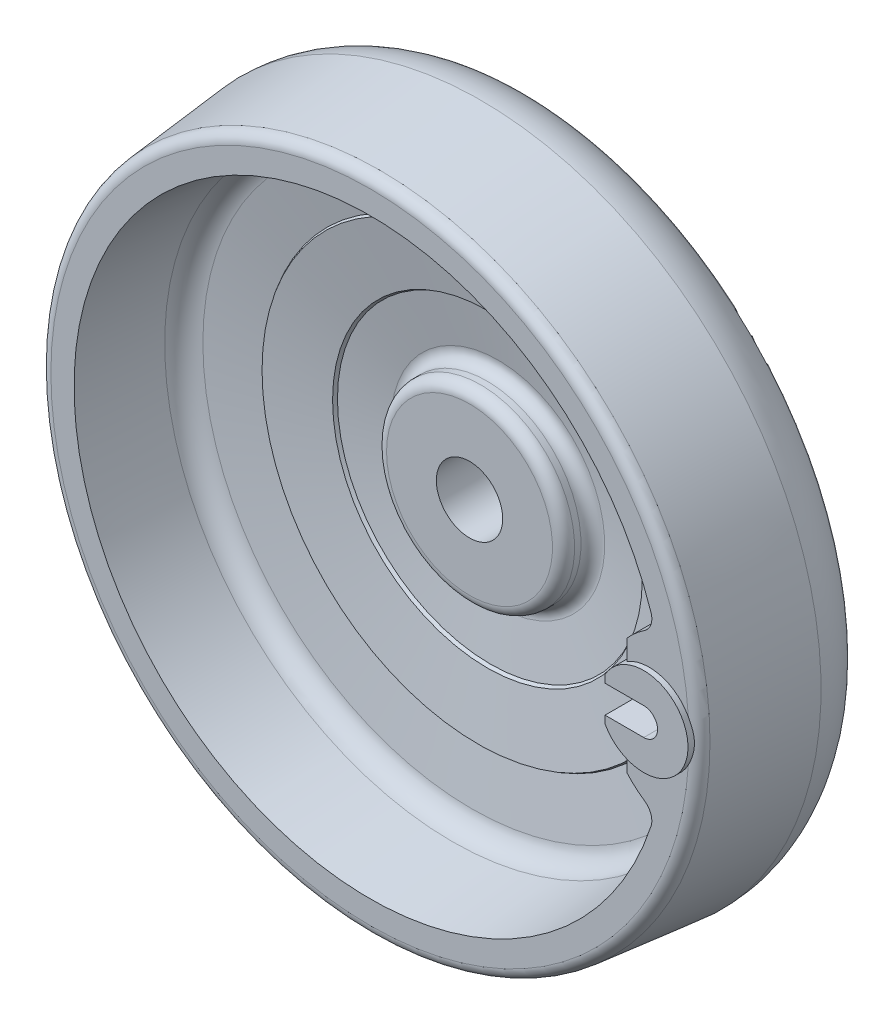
ISO-10303-21;
HEADER;
FILE_DESCRIPTION(('STEP AP214'),'2;1');
FILE_NAME('part.step','',(''),(''),'','','');
FILE_SCHEMA(('AUTOMOTIVE_DESIGN { 1 0 10303 214 1 1 1 1 }'));
ENDSEC;
DATA;
#1=APPLICATION_CONTEXT('core data for automotive mechanical design processes');
#2=APPLICATION_PROTOCOL_DEFINITION('international standard','automotive_design',2000,#1);
#3=PRODUCT_CONTEXT('',#1,'mechanical');
#4=PRODUCT('Part','Part','',(#3));
#5=PRODUCT_RELATED_PRODUCT_CATEGORY('part','',(#4));
#6=PRODUCT_DEFINITION_FORMATION('','',#4);
#7=PRODUCT_DEFINITION_CONTEXT('part definition',#1,'design');
#8=PRODUCT_DEFINITION('design','',#6,#7);
#9=PRODUCT_DEFINITION_SHAPE('','',#8);
#10=(LENGTH_UNIT() NAMED_UNIT(*) SI_UNIT(.MILLI.,.METRE.));
#11=(NAMED_UNIT(*) PLANE_ANGLE_UNIT() SI_UNIT($,.RADIAN.));
#12=(NAMED_UNIT(*) SI_UNIT($,.STERADIAN.) SOLID_ANGLE_UNIT());
#13=UNCERTAINTY_MEASURE_WITH_UNIT(LENGTH_MEASURE(1.E-05),#10,'distance_accuracy_value','');
#14=(GEOMETRIC_REPRESENTATION_CONTEXT(3) GLOBAL_UNCERTAINTY_ASSIGNED_CONTEXT((#13)) GLOBAL_UNIT_ASSIGNED_CONTEXT((#10,
#11,#12)) REPRESENTATION_CONTEXT('',''));
#15=CARTESIAN_POINT('',(0.,0.,0.));
#16=DIRECTION('',(0.,0.,1.));
#17=DIRECTION('',(1.,0.,0.));
#18=AXIS2_PLACEMENT_3D('',#15,#16,#17);
#19=CARTESIAN_POINT('',(43.5,2.49999999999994,29.));
#20=DIRECTION('',(0.,-1.,0.));
#21=DIRECTION('',(0.,0.,-1.));
#22=AXIS2_PLACEMENT_3D('',#19,#20,#21);
#23=PLANE('',#22);
#24=DIRECTION('',(0.,0.,1.));
#25=VECTOR('',#24,1.);
#26=CARTESIAN_POINT('',(50.5,2.49999999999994,29.));
#27=LINE('',#26,#25);
#28=CARTESIAN_POINT('',(50.5,2.49999999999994,29.));
#29=VERTEX_POINT('',#28);
#30=CARTESIAN_POINT('',(50.5,2.49999999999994,33.25));
#31=VERTEX_POINT('',#30);
#32=EDGE_CURVE('E451',#29,#31,#27,.T.);
#33=ORIENTED_EDGE('',*,*,#32,.T.);
#34=CARTESIAN_POINT('',(50.5,2.49999999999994,34.));
#35=DIRECTION('',(0.,-1.,0.));
#36=DIRECTION('',(0.,0.,-1.));
#37=AXIS2_PLACEMENT_3D('',#34,#35,#36);
#38=CIRCLE('',#37,0.749999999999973);
#39=CARTESIAN_POINT('',(50.5,2.49999999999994,34.75));
#40=VERTEX_POINT('',#39);
#41=EDGE_CURVE('E472',#31,#40,#38,.F.);
#42=ORIENTED_EDGE('',*,*,#41,.T.);
#43=CARTESIAN_POINT('',(50.5,2.49999999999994,41.));
#44=VERTEX_POINT('',#43);
#45=EDGE_CURVE('E452',#40,#44,#27,.T.);
#46=ORIENTED_EDGE('',*,*,#45,.T.);
#47=DIRECTION('',(1.,0.,0.));
#48=VECTOR('',#47,1.);
#49=CARTESIAN_POINT('',(43.5,2.49999999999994,41.));
#50=LINE('',#49,#48);
#51=CARTESIAN_POINT('',(43.5,2.49999999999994,41.));
#52=VERTEX_POINT('',#51);
#53=EDGE_CURVE('E466',#52,#44,#50,.T.);
#54=ORIENTED_EDGE('',*,*,#53,.F.);
#55=DIRECTION('',(0.,0.,1.));
#56=VECTOR('',#55,1.);
#57=CARTESIAN_POINT('',(43.5,2.49999999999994,29.));
#58=LINE('',#57,#56);
#59=CARTESIAN_POINT('',(43.5,2.49999999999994,29.));
#60=VERTEX_POINT('',#59);
#61=EDGE_CURVE('E448',#60,#52,#58,.T.);
#62=ORIENTED_EDGE('',*,*,#61,.F.);
#63=DIRECTION('',(1.,0.,0.));
#64=VECTOR('',#63,1.);
#65=CARTESIAN_POINT('',(43.5,2.49999999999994,29.));
#66=LINE('',#65,#64);
#67=EDGE_CURVE('E455',#60,#29,#66,.T.);
#68=ORIENTED_EDGE('',*,*,#67,.T.);
#69=EDGE_LOOP('',(#33,#42,#46,#54,#62,#68));
#70=FACE_BOUND('',#69,.T.);
#71=ADVANCED_FACE('F14',(#70),#23,.T.);
#72=CARTESIAN_POINT('',(50.5,0.,29.));
#73=DIRECTION('',(0.,0.,1.));
#74=DIRECTION('',(-1.,0.,0.));
#75=AXIS2_PLACEMENT_3D('',#72,#73,#74);
#76=CYLINDRICAL_SURFACE('',#75,2.49999999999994);
#77=CARTESIAN_POINT('',(50.5,2.49999999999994,33.25));
#78=CARTESIAN_POINT('',(50.5412208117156,2.50003715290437,33.2499599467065));
#79=CARTESIAN_POINT('',(50.5824119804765,2.49898175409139,33.2533954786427));
#80=CARTESIAN_POINT('',(50.6634983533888,2.49496742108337,33.2668990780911));
#81=CARTESIAN_POINT('',(50.7033964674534,2.4920131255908,33.2769509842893));
#82=CARTESIAN_POINT('',(50.7808626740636,2.48448092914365,33.3033683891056));
#83=CARTESIAN_POINT('',(50.8184313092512,2.47990340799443,33.3197324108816));
#84=CARTESIAN_POINT('',(50.8903028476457,2.46961130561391,33.3582630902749));
#85=CARTESIAN_POINT('',(50.9246044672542,2.46389628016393,33.3804320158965));
#86=CARTESIAN_POINT('',(50.9899350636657,2.45175406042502,33.4306110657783));
#87=CARTESIAN_POINT('',(51.0208572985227,2.44531233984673,33.4587566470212));
#88=CARTESIAN_POINT('',(51.0776230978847,2.43252948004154,33.5198027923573));
#89=CARTESIAN_POINT('',(51.1034655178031,2.42618836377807,33.5527044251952));
#90=CARTESIAN_POINT('',(51.1499007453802,2.41417044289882,33.6232361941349));
#91=CARTESIAN_POINT('',(51.1703625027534,2.40851177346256,33.6609559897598));
#92=CARTESIAN_POINT('',(51.2046076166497,2.39871790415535,33.7394965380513));
#93=CARTESIAN_POINT('',(51.218392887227,2.39458226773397,33.7803163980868));
#94=CARTESIAN_POINT('',(51.2385080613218,2.38845438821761,33.8626946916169));
#95=CARTESIAN_POINT('',(51.2450358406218,2.38640539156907,33.9042004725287));
#96=CARTESIAN_POINT('',(51.2510686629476,2.38451394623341,33.9877656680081));
#97=CARTESIAN_POINT('',(51.2505752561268,2.38467101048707,34.0298249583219));
#98=CARTESIAN_POINT('',(51.2427348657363,2.38712372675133,34.111692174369));
#99=CARTESIAN_POINT('',(51.235635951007,2.38934196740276,34.1515265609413));
#100=CARTESIAN_POINT('',(51.2151869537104,2.39554182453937,34.2294103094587));
#101=CARTESIAN_POINT('',(51.2018363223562,2.39952359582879,34.2674595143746));
#102=CARTESIAN_POINT('',(51.1690800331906,2.40886369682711,34.34130042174));
#103=CARTESIAN_POINT('',(51.1495938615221,2.41424015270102,34.3770540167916));
#104=CARTESIAN_POINT('',(51.1051757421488,2.42575501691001,34.4448664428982));
#105=CARTESIAN_POINT('',(51.0802425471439,2.43189359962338,34.4769244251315));
#106=CARTESIAN_POINT('',(51.0244093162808,2.44455444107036,34.5378401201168));
#107=CARTESIAN_POINT('',(50.9933039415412,2.45108202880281,34.566508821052));
#108=CARTESIAN_POINT('',(50.9266378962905,2.46356007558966,34.6182725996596));
#109=CARTESIAN_POINT('',(50.8910760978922,2.4695103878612,34.6413662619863));
#110=CARTESIAN_POINT('',(50.8161571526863,2.48021901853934,34.6814418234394));
#111=CARTESIAN_POINT('',(50.776774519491,2.48496844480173,34.6983785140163));
#112=CARTESIAN_POINT('',(50.6955650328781,2.49267109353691,34.725312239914));
#113=CARTESIAN_POINT('',(50.6537418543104,2.49562694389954,34.7353194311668));
#114=CARTESIAN_POINT('',(50.5929418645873,2.49834060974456,34.7444535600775));
#115=CARTESIAN_POINT('',(50.5744057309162,2.49896174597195,34.7465333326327));
#116=CARTESIAN_POINT('',(50.5372495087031,2.49979140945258,34.749305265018));
#117=CARTESIAN_POINT('',(50.5186295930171,2.50000056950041,34.7499995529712));
#118=CARTESIAN_POINT('',(50.5,2.49999999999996,34.75));
#119=B_SPLINE_CURVE_WITH_KNOTS('',3,(#77,#78,#79,#80,#81,#82,#83,#84,#85,#86,#87,#88,#89,#90,
#91,#92,#93,#94,#95,#96,#97,#98,#99,#100,#101,#102,#103,#104,#105,#106,#107,#108,#109,#110,#111,
#112,#113,#114,#115,#116,#117,#118),.UNSPECIFIED.,.F.,.F.,(4,2,2,2,2,2,2,2,2,2,2,2,2,2,2,2,2,2,
2,2,4),(0.,0.123460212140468,0.246619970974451,0.369750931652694,0.492930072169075,
0.619274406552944,0.745647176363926,0.874860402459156,1.00403656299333,1.12959708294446,
1.25512988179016,1.37613073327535,1.49714220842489,1.61981293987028,1.7425117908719,
1.87032332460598,1.99816727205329,2.12693182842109,2.25550726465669,2.31144879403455,
2.36730433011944),.UNSPECIFIED.);
#120=EDGE_CURVE('E29',#31,#40,#119,.T.);
#121=ORIENTED_EDGE('',*,*,#120,.F.);
#122=ORIENTED_EDGE('',*,*,#32,.F.);
#123=CARTESIAN_POINT('',(50.5,0.,29.));
#124=DIRECTION('',(0.,0.,1.));
#125=DIRECTION('',(-1.,0.,0.));
#126=AXIS2_PLACEMENT_3D('',#123,#124,#125);
#127=CIRCLE('',#126,2.49999999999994);
#128=CARTESIAN_POINT('',(50.5,-2.49999999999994,29.));
#129=VERTEX_POINT('',#128);
#130=EDGE_CURVE('E458',#129,#29,#127,.T.);
#131=ORIENTED_EDGE('',*,*,#130,.F.);
#132=DIRECTION('',(0.,0.,1.));
#133=VECTOR('',#132,1.);
#134=CARTESIAN_POINT('',(50.5,-2.49999999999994,29.));
#135=LINE('',#134,#133);
#136=CARTESIAN_POINT('',(50.5,-2.49999999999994,33.25));
#137=VERTEX_POINT('',#136);
#138=EDGE_CURVE('E142',#129,#137,#135,.T.);
#139=ORIENTED_EDGE('',*,*,#138,.T.);
#140=CARTESIAN_POINT('',(50.5,-2.49999999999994,34.75));
#141=CARTESIAN_POINT('',(50.5412208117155,-2.50003715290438,34.7500400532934));
#142=CARTESIAN_POINT('',(50.5824119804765,-2.4989817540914,34.7466045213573));
#143=CARTESIAN_POINT('',(50.6634983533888,-2.49496742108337,34.7331009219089));
#144=CARTESIAN_POINT('',(50.7033964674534,-2.4920131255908,34.7230490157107));
#145=CARTESIAN_POINT('',(50.7808626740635,-2.48448092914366,34.6966316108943));
#146=CARTESIAN_POINT('',(50.818431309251,-2.47990340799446,34.6802675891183));
#147=CARTESIAN_POINT('',(50.8903028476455,-2.46961130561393,34.6417369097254));
#148=CARTESIAN_POINT('',(50.9246044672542,-2.4638962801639,34.6195679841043));
#149=CARTESIAN_POINT('',(50.9899350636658,-2.45175406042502,34.5693889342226));
#150=CARTESIAN_POINT('',(51.0208572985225,-2.44531233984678,34.5412433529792));
#151=CARTESIAN_POINT('',(51.0776230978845,-2.4325294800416,34.4801972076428));
#152=CARTESIAN_POINT('',(51.103465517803,-2.4261883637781,34.4472955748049));
#153=CARTESIAN_POINT('',(51.1499007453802,-2.4141704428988,34.3767638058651));
#154=CARTESIAN_POINT('',(51.1703625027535,-2.40851177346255,34.3390440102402));
#155=CARTESIAN_POINT('',(51.2046076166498,-2.39871790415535,34.2605034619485));
#156=CARTESIAN_POINT('',(51.218392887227,-2.39458226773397,34.2196836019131));
#157=CARTESIAN_POINT('',(51.2385080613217,-2.38845438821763,34.1373053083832));
#158=CARTESIAN_POINT('',(51.2450358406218,-2.38640539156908,34.0957995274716));
#159=CARTESIAN_POINT('',(51.2510686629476,-2.38451394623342,34.0122343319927));
#160=CARTESIAN_POINT('',(51.2505752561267,-2.38467101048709,33.970175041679));
#161=CARTESIAN_POINT('',(51.2427348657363,-2.38712372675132,33.8883078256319));
#162=CARTESIAN_POINT('',(51.2356359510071,-2.38934196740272,33.8484734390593));
#163=CARTESIAN_POINT('',(51.2151869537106,-2.39554182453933,33.7705896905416));
#164=CARTESIAN_POINT('',(51.2018363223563,-2.39952359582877,33.7325404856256));
#165=CARTESIAN_POINT('',(51.1690800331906,-2.40886369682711,33.65869957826));
#166=CARTESIAN_POINT('',(51.1495938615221,-2.41424015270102,33.6229459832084));
#167=CARTESIAN_POINT('',(51.1051757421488,-2.42575501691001,33.5551335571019));
#168=CARTESIAN_POINT('',(51.0802425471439,-2.43189359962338,33.5230755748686));
#169=CARTESIAN_POINT('',(51.0244093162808,-2.44455444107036,33.4621598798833));
#170=CARTESIAN_POINT('',(50.9933039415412,-2.45108202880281,33.433491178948));
#171=CARTESIAN_POINT('',(50.9266378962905,-2.46356007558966,33.3817274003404));
#172=CARTESIAN_POINT('',(50.8910760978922,-2.46951038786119,33.3586337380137));
#173=CARTESIAN_POINT('',(50.8161571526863,-2.48021901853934,33.3185581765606));
#174=CARTESIAN_POINT('',(50.776774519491,-2.48496844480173,33.3016214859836));
#175=CARTESIAN_POINT('',(50.6955650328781,-2.49267109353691,33.274687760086));
#176=CARTESIAN_POINT('',(50.6537418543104,-2.49562694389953,33.2646805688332));
#177=CARTESIAN_POINT('',(50.5929418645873,-2.49834060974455,33.2555464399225));
#178=CARTESIAN_POINT('',(50.5744057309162,-2.49896174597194,33.2534666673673));
#179=CARTESIAN_POINT('',(50.5372495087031,-2.49979140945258,33.250694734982));
#180=CARTESIAN_POINT('',(50.5186295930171,-2.50000056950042,33.2500004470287));
#181=CARTESIAN_POINT('',(50.5,-2.49999999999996,33.25));
#182=B_SPLINE_CURVE_WITH_KNOTS('',3,(#140,#141,#142,#143,#144,#145,#146,#147,#148,#149,#150,
#151,#152,#153,#154,#155,#156,#157,#158,#159,#160,#161,#162,#163,#164,#165,#166,#167,#168,#169,
#170,#171,#172,#173,#174,#175,#176,#177,#178,#179,#180,#181),.UNSPECIFIED.,.F.,.F.,(4,2,2,2,2,2,
2,2,2,2,2,2,2,2,2,2,2,2,2,2,4),(0.,0.123460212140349,0.246619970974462,0.369750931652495,
0.492930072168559,0.619274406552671,0.745647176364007,0.874860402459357,1.00403656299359,
1.12959708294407,1.25512988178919,1.37613073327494,1.49714220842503,1.61981293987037,
1.74251179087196,1.87032332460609,1.99816727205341,2.12693182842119,2.25550726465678,
2.31144879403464,2.36730433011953),.UNSPECIFIED.);
#183=CARTESIAN_POINT('',(50.5,-2.49999999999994,34.75));
#184=VERTEX_POINT('',#183);
#185=EDGE_CURVE('E146',#184,#137,#182,.T.);
#186=ORIENTED_EDGE('',*,*,#185,.F.);
#187=CARTESIAN_POINT('',(50.5,-2.49999999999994,41.));
#188=VERTEX_POINT('',#187);
#189=EDGE_CURVE('E135',#184,#188,#135,.T.);
#190=ORIENTED_EDGE('',*,*,#189,.T.);
#191=CARTESIAN_POINT('',(50.5,0.,41.));
#192=DIRECTION('',(0.,0.,1.));
#193=DIRECTION('',(-1.,0.,0.));
#194=AXIS2_PLACEMENT_3D('',#191,#192,#193);
#195=CIRCLE('',#194,2.49999999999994);
#196=EDGE_CURVE('E469',#188,#44,#195,.T.);
#197=ORIENTED_EDGE('',*,*,#196,.T.);
#198=ORIENTED_EDGE('',*,*,#45,.F.);
#199=EDGE_LOOP('',(#121,#122,#131,#139,#186,#190,#197,#198));
#200=FACE_BOUND('',#199,.T.);
#201=ADVANCED_FACE('F147',(#200),#76,.F.);
#202=CARTESIAN_POINT('',(43.5,-2.49999999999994,29.));
#203=DIRECTION('',(0.,-1.,0.));
#204=DIRECTION('',(-1.,0.,0.));
#205=AXIS2_PLACEMENT_3D('',#202,#203,#204);
#206=PLANE('',#205);
#207=CARTESIAN_POINT('',(50.5,-2.49999999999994,34.));
#208=DIRECTION('',(0.,-1.,0.));
#209=DIRECTION('',(-1.,0.,0.));
#210=AXIS2_PLACEMENT_3D('',#207,#208,#209);
#211=CIRCLE('',#210,0.749999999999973);
#212=EDGE_CURVE('E9',#137,#184,#211,.F.);
#213=ORIENTED_EDGE('',*,*,#212,.F.);
#214=ORIENTED_EDGE('',*,*,#138,.F.);
#215=DIRECTION('',(1.,0.,0.));
#216=VECTOR('',#215,1.);
#217=CARTESIAN_POINT('',(43.5,-2.49999999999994,29.));
#218=LINE('',#217,#216);
#219=CARTESIAN_POINT('',(43.5,-2.49999999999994,29.));
#220=VERTEX_POINT('',#219);
#221=EDGE_CURVE('E461',#220,#129,#218,.T.);
#222=ORIENTED_EDGE('',*,*,#221,.F.);
#223=DIRECTION('',(0.,0.,1.));
#224=VECTOR('',#223,1.);
#225=CARTESIAN_POINT('',(43.5,-2.49999999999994,29.));
#226=LINE('',#225,#224);
#227=CARTESIAN_POINT('',(43.5,-2.49999999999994,41.));
#228=VERTEX_POINT('',#227);
#229=EDGE_CURVE('E143',#220,#228,#226,.T.);
#230=ORIENTED_EDGE('',*,*,#229,.T.);
#231=DIRECTION('',(1.,0.,0.));
#232=VECTOR('',#231,1.);
#233=CARTESIAN_POINT('',(43.5,-2.49999999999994,41.));
#234=LINE('',#233,#232);
#235=EDGE_CURVE('E139',#228,#188,#234,.T.);
#236=ORIENTED_EDGE('',*,*,#235,.T.);
#237=ORIENTED_EDGE('',*,*,#189,.F.);
#238=EDGE_LOOP('',(#213,#214,#222,#230,#236,#237));
#239=FACE_BOUND('',#238,.T.);
#240=ADVANCED_FACE('F137',(#239),#206,.F.);
#241=CARTESIAN_POINT('',(43.5,3.8729833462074,20.));
#242=DIRECTION('',(-1.,0.,0.));
#243=DIRECTION('',(0.,0.,-1.));
#244=AXIS2_PLACEMENT_3D('',#241,#242,#243);
#245=PLANE('',#244);
#246=DIRECTION('',(0.,-1.,0.));
#247=VECTOR('',#246,1.);
#248=CARTESIAN_POINT('',(43.5,2.49999999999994,29.));
#249=LINE('',#248,#247);
#250=EDGE_CURVE('E464',#60,#220,#249,.T.);
#251=ORIENTED_EDGE('',*,*,#250,.F.);
#252=ORIENTED_EDGE('',*,*,#61,.T.);
#253=DIRECTION('',(0.,-1.,0.));
#254=VECTOR('',#253,1.);
#255=CARTESIAN_POINT('',(43.5,3.8729833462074,41.));
#256=LINE('',#255,#254);
#257=CARTESIAN_POINT('',(43.5,3.8729833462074,41.));
#258=VERTEX_POINT('',#257);
#259=EDGE_CURVE('E441',#258,#52,#256,.T.);
#260=ORIENTED_EDGE('',*,*,#259,.F.);
#261=DIRECTION('',(0.,0.,1.));
#262=VECTOR('',#261,1.);
#263=CARTESIAN_POINT('',(43.5,3.8729833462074,20.));
#264=LINE('',#263,#262);
#265=CARTESIAN_POINT('',(43.5,3.87298334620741,20.7520696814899));
#266=VERTEX_POINT('',#265);
#267=EDGE_CURVE('E432',#266,#258,#264,.T.);
#268=ORIENTED_EDGE('',*,*,#267,.F.);
#269=CARTESIAN_POINT('',(43.5,11.8585675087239,20.977704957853));
#270=CARTESIAN_POINT('',(43.5,11.1127329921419,20.9464284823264));
#271=CARTESIAN_POINT('',(43.5,10.3667847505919,20.9179019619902));
#272=CARTESIAN_POINT('',(43.5,8.87468948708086,20.8665356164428));
#273=CARTESIAN_POINT('',(43.5,8.1285424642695,20.8436958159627));
#274=CARTESIAN_POINT('',(43.5,5.89025841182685,20.783997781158));
#275=CARTESIAN_POINT('',(43.5,4.39787612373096,20.7559438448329));
#276=CARTESIAN_POINT('',(43.5,1.41283402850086,20.7242322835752));
#277=CARTESIAN_POINT('',(43.5,-0.0798257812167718,20.7205748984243));
#278=CARTESIAN_POINT('',(43.5,-2.31889076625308,20.7334638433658));
#279=CARTESIAN_POINT('',(43.5,-3.06535867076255,20.7408248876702));
#280=CARTESIAN_POINT('',(43.5,-4.55820955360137,20.7615975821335));
#281=CARTESIAN_POINT('',(43.5,-5.30459253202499,20.7750092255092));
#282=CARTESIAN_POINT('',(43.5,-6.05091234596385,20.791407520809));
#283=B_SPLINE_CURVE_WITH_KNOTS('',3,(#269,#270,#271,#272,#273,#274,#275,#276,#277,#278,#279,
#280,#281,#282),.UNSPECIFIED.,.F.,.F.,(4,2,2,2,2,2,4),(0.,2.23946097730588,4.47893169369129,
8.95666535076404,13.4344430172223,15.6739341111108,17.9134226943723),.UNSPECIFIED.);
#284=CARTESIAN_POINT('',(43.5,-3.87298334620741,20.7520696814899));
#285=VERTEX_POINT('',#284);
#286=EDGE_CURVE('E22',#266,#285,#283,.T.);
#287=ORIENTED_EDGE('',*,*,#286,.T.);
#288=DIRECTION('',(0.,0.,1.));
#289=VECTOR('',#288,1.);
#290=CARTESIAN_POINT('',(43.5,-3.87298334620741,20.));
#291=LINE('',#290,#289);
#292=CARTESIAN_POINT('',(43.5,-3.87298334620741,41.));
#293=VERTEX_POINT('',#292);
#294=EDGE_CURVE('E429',#285,#293,#291,.T.);
#295=ORIENTED_EDGE('',*,*,#294,.T.);
#296=EDGE_CURVE('E446',#228,#293,#256,.T.);
#297=ORIENTED_EDGE('',*,*,#296,.F.);
#298=ORIENTED_EDGE('',*,*,#229,.F.);
#299=EDGE_LOOP('',(#251,#252,#260,#268,#287,#295,#297,#298));
#300=FACE_BOUND('',#299,.T.);
#301=ADVANCED_FACE('F181',(#300),#245,.T.);
#302=CARTESIAN_POINT('',(50.5,0.,41.));
#303=DIRECTION('',(0.,0.,1.));
#304=DIRECTION('',(-1.,0.,0.));
#305=AXIS2_PLACEMENT_3D('',#302,#303,#304);
#306=PLANE('',#305);
#307=ORIENTED_EDGE('',*,*,#259,.T.);
#308=ORIENTED_EDGE('',*,*,#53,.T.);
#309=ORIENTED_EDGE('',*,*,#196,.F.);
#310=ORIENTED_EDGE('',*,*,#235,.F.);
#311=ORIENTED_EDGE('',*,*,#296,.T.);
#312=CARTESIAN_POINT('',(50.5,0.,41.));
#313=DIRECTION('',(0.,0.,1.));
#314=DIRECTION('',(-1.,0.,0.));
#315=AXIS2_PLACEMENT_3D('',#312,#313,#314);
#316=CIRCLE('',#315,8.);
#317=EDGE_CURVE('E437',#293,#258,#316,.T.);
#318=ORIENTED_EDGE('',*,*,#317,.T.);
#319=EDGE_LOOP('',(#307,#308,#309,#310,#311,#318));
#320=FACE_BOUND('',#319,.T.);
#321=ADVANCED_FACE('F177',(#320),#306,.T.);
#322=CARTESIAN_POINT('',(46.5,10.5830052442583,20.));
#323=DIRECTION('',(-1.,0.,0.));
#324=DIRECTION('',(0.,0.,-1.));
#325=AXIS2_PLACEMENT_3D('',#322,#323,#324);
#326=PLANE('',#325);
#327=DIRECTION('',(0.,0.,1.));
#328=VECTOR('',#327,1.);
#329=CARTESIAN_POINT('',(46.5,-6.92820323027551,20.));
#330=LINE('',#329,#328);
#331=CARTESIAN_POINT('',(46.5,-6.92820323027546,21.2847283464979));
#332=VERTEX_POINT('',#331);
#333=CARTESIAN_POINT('',(46.5,-6.92820323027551,40.));
#334=VERTEX_POINT('',#333);
#335=EDGE_CURVE('E416',#332,#334,#330,.T.);
#336=ORIENTED_EDGE('',*,*,#335,.F.);
#337=CARTESIAN_POINT('',(46.5,29.5353486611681,22.571853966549));
#338=CARTESIAN_POINT('',(46.5,28.6359911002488,22.4949841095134));
#339=CARTESIAN_POINT('',(46.5,27.7364192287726,22.4205933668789));
#340=CARTESIAN_POINT('',(46.5,25.9368539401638,22.2771893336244));
#341=CARTESIAN_POINT('',(46.5,25.0368605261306,22.2081760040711));
#342=CARTESIAN_POINT('',(46.5,23.2363761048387,22.0759397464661));
#343=CARTESIAN_POINT('',(46.5,22.3358850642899,22.0127172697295));
#344=CARTESIAN_POINT('',(46.5,20.5344771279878,21.8924929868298));
#345=CARTESIAN_POINT('',(46.5,19.6335602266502,21.8354912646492));
#346=CARTESIAN_POINT('',(46.5,16.9323525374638,21.6745837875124));
#347=CARTESIAN_POINT('',(46.5,15.1314546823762,21.5806158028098));
#348=CARTESIAN_POINT('',(46.5,11.5283665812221,21.4223347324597));
#349=CARTESIAN_POINT('',(46.5,9.72617634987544,21.358021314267));
#350=CARTESIAN_POINT('',(46.5,6.1205050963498,21.2614680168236));
#351=CARTESIAN_POINT('',(46.5,4.31702387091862,21.2292356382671));
#352=CARTESIAN_POINT('',(46.5,0.70973084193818,21.1982030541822));
#353=CARTESIAN_POINT('',(46.5,-1.0940809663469,21.1994033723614));
#354=CARTESIAN_POINT('',(46.5,-3.800562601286,21.2262259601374));
#355=CARTESIAN_POINT('',(46.5,-4.70337371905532,21.2393520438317));
#356=CARTESIAN_POINT('',(46.5,-6.50884334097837,21.2738054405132));
#357=CARTESIAN_POINT('',(46.5,-7.41150184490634,21.2951327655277));
#358=CARTESIAN_POINT('',(46.5,-9.21658106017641,21.3457818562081));
#359=CARTESIAN_POINT('',(46.5,-10.1190017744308,21.3751035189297));
#360=CARTESIAN_POINT('',(46.5,-11.9235556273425,21.4414457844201));
#361=CARTESIAN_POINT('',(46.5,-12.8256887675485,21.478466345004));
#362=CARTESIAN_POINT('',(46.5,-13.7276523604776,21.519188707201));
#363=B_SPLINE_CURVE_WITH_KNOTS('',3,(#337,#338,#339,#340,#341,#342,#343,#344,#345,#346,#347,
#348,#349,#350,#351,#352,#353,#354,#355,#356,#357,#358,#359,#360,#361,#362),.UNSPECIFIED.,.F.,
.F.,(4,2,2,2,2,2,2,2,2,2,2,2,4),(0.,2.70791006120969,5.41580051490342,8.12390183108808,
10.8320397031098,16.2418479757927,21.6515955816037,27.0626077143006,32.4737046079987,
35.1823933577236,37.891086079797,40.5997439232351,43.3083869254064),.UNSPECIFIED.);
#364=CARTESIAN_POINT('',(46.5,-10.5830052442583,21.3924647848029));
#365=VERTEX_POINT('',#364);
#366=EDGE_CURVE('E413',#332,#365,#363,.T.);
#367=ORIENTED_EDGE('',*,*,#366,.T.);
#368=DIRECTION('',(0.,0.,1.));
#369=VECTOR('',#368,1.);
#370=CARTESIAN_POINT('',(46.5,-10.5830052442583,20.));
#371=LINE('',#370,#369);
#372=CARTESIAN_POINT('',(46.5,-10.5830052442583,40.));
#373=VERTEX_POINT('',#372);
#374=EDGE_CURVE('E501',#365,#373,#371,.T.);
#375=ORIENTED_EDGE('',*,*,#374,.T.);
#376=DIRECTION('',(0.,-1.,0.));
#377=VECTOR('',#376,1.);
#378=CARTESIAN_POINT('',(46.5,10.5830052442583,40.));
#379=LINE('',#378,#377);
#380=EDGE_CURVE('E531',#334,#373,#379,.T.);
#381=ORIENTED_EDGE('',*,*,#380,.F.);
#382=EDGE_LOOP('',(#336,#367,#375,#381));
#383=FACE_BOUND('',#382,.T.);
#384=ADVANCED_FACE('F180',(#383),#326,.T.);
#385=CARTESIAN_POINT('',(0.,0.,25.101253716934));
#386=DIRECTION('',(0.,0.,1.));
#387=DIRECTION('',(-1.,0.,0.));
#388=AXIS2_PLACEMENT_3D('',#385,#386,#387);
#389=CONICAL_SURFACE('',#388,52.0147712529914,0.099359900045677);
#390=CARTESIAN_POINT('',(0.,0.,25.101253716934));
#391=DIRECTION('',(0.,0.,1.));
#392=DIRECTION('',(-1.,0.,0.));
#393=AXIS2_PLACEMENT_3D('',#390,#391,#392);
#394=CIRCLE('',#393,52.0147712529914);
#395=CARTESIAN_POINT('',(50.1595852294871,13.7678044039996,25.101253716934));
#396=VERTEX_POINT('',#395);
#397=CARTESIAN_POINT('',(50.1595852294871,-13.7678044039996,25.101253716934));
#398=VERTEX_POINT('',#397);
#399=EDGE_CURVE('E322',#396,#398,#394,.T.);
#400=ORIENTED_EDGE('',*,*,#399,.F.);
#401=CARTESIAN_POINT('',(50.1595692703,13.7677872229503,25.1010537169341));
#402=CARTESIAN_POINT('',(50.1991880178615,13.8104724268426,25.5976559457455));
#403=CARTESIAN_POINT('',(50.2382641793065,13.8550003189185,26.0941484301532));
#404=CARTESIAN_POINT('',(50.3151488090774,13.9482784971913,27.0868659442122));
#405=CARTESIAN_POINT('',(50.3529571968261,13.9970290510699,27.5830909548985));
#406=CARTESIAN_POINT('',(50.4271324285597,14.0993032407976,28.5753463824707));
#407=CARTESIAN_POINT('',(50.4634987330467,14.1528286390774,29.0713766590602));
#408=CARTESIAN_POINT('',(50.5345059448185,14.2654073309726,30.062923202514));
#409=CARTESIAN_POINT('',(50.5691468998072,14.3244604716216,30.5584394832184));
#410=CARTESIAN_POINT('',(50.6368561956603,14.4501593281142,31.5565841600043));
#411=CARTESIAN_POINT('',(50.6698911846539,14.5169099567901,32.0592016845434));
#412=CARTESIAN_POINT('',(50.7332066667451,14.6588945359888,33.0633887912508));
#413=CARTESIAN_POINT('',(50.7634873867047,14.7341277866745,33.5649584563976));
#414=CARTESIAN_POINT('',(50.8110718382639,14.8695786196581,34.4036667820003));
#415=CARTESIAN_POINT('',(50.8293936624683,14.9267245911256,34.7412424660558));
#416=CARTESIAN_POINT('',(50.8638426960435,15.0475419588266,35.4153564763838));
#417=CARTESIAN_POINT('',(50.8799699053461,15.1112133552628,35.7518948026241));
#418=CARTESIAN_POINT('',(50.9044855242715,15.2253372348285,36.3147592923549));
#419=CARTESIAN_POINT('',(50.9136899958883,15.2734058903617,36.5415319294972));
#420=CARTESIAN_POINT('',(50.9303083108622,15.3747059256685,36.9939853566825));
#421=CARTESIAN_POINT('',(50.9377223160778,15.4279368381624,37.219666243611));
#422=CARTESIAN_POINT('',(50.94809631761,15.5232224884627,37.5972101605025));
#423=CARTESIAN_POINT('',(50.9517221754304,15.5633851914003,37.7495309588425));
#424=CARTESIAN_POINT('',(50.957484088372,15.6479044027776,38.0530735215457));
#425=CARTESIAN_POINT('',(50.9596199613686,15.692261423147,38.2042951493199));
#426=CARTESIAN_POINT('',(50.9614732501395,15.7717536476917,38.4573756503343));
#427=CARTESIAN_POINT('',(50.9617421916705,15.8053635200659,38.559707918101));
#428=CARTESIAN_POINT('',(50.9610106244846,15.8760337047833,38.7631235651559));
#429=CARTESIAN_POINT('',(50.9600108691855,15.9130919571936,38.8642076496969));
#430=CARTESIAN_POINT('',(50.956829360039,15.9797216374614,39.0334334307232));
#431=CARTESIAN_POINT('',(50.9551102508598,16.0080514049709,39.1020706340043));
#432=CARTESIAN_POINT('',(50.9505638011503,16.0676352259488,39.2380194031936));
#433=CARTESIAN_POINT('',(50.9477368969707,16.0988881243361,39.3053314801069));
#434=CARTESIAN_POINT('',(50.940556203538,16.1652784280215,39.437712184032));
#435=CARTESIAN_POINT('',(50.9362065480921,16.2004051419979,39.5027863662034));
#436=CARTESIAN_POINT('',(50.9252593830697,16.2762627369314,39.6293068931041));
#437=CARTESIAN_POINT('',(50.9186696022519,16.3169740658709,39.6907648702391));
#438=CARTESIAN_POINT('',(50.9066124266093,16.3812753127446,39.7729832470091));
#439=CARTESIAN_POINT('',(50.9026858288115,16.4012157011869,39.7967907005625));
#440=CARTESIAN_POINT('',(50.8939302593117,16.4431908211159,39.8424954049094));
#441=CARTESIAN_POINT('',(50.8890983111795,16.4652323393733,39.8643859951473));
#442=CARTESIAN_POINT('',(50.8781886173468,16.5121866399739,39.9054722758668));
#443=CARTESIAN_POINT('',(50.872090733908,16.5371425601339,39.9246146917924));
#444=CARTESIAN_POINT('',(50.8584190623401,16.5897786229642,39.957700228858));
#445=CARTESIAN_POINT('',(50.8508601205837,16.6174300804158,39.9716918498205));
#446=CARTESIAN_POINT('',(50.8377088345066,16.6627088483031,39.9876448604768));
#447=CARTESIAN_POINT('',(50.8326559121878,16.6795719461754,39.9921920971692));
#448=CARTESIAN_POINT('',(50.8220272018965,16.7139171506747,39.9984193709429));
#449=CARTESIAN_POINT('',(50.8164450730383,16.7314046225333,40.0000582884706));
#450=CARTESIAN_POINT('',(50.8106728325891,16.7488962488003,39.9999999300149));
#451=B_SPLINE_CURVE_WITH_KNOTS('',3,(#401,#402,#403,#404,#405,#406,#407,#408,#409,#410,#411,
#412,#413,#414,#415,#416,#417,#418,#419,#420,#421,#422,#423,#424,#425,#426,#427,#428,#429,#430,
#431,#432,#433,#434,#435,#436,#437,#438,#439,#440,#441,#442,#443,#444,#445,#446,#447,#448,#449,
#450),.UNSPECIFIED.,.F.,.F.,(4,2,2,2,2,2,2,2,2,2,2,2,2,2,2,2,2,2,2,2,2,2,2,2,4),(0.,
1.50002053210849,3.00013622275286,4.50080792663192,6.00143811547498,7.52569763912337,
9.04983149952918,10.0783884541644,11.1069454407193,11.8028822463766,12.4987561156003,
12.9714173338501,13.4441363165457,13.767222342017,14.0901165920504,14.3128869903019,
14.5355697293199,14.7576525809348,14.9789768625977,15.072785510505,15.1669081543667,
15.262661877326,15.3574894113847,15.4118056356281,15.4668838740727),.UNSPECIFIED.);
#452=CARTESIAN_POINT('',(50.8107387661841,16.7486962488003,40.));
#453=VERTEX_POINT('',#452);
#454=EDGE_CURVE('E246',#396,#453,#451,.T.);
#455=ORIENTED_EDGE('',*,*,#454,.T.);
#456=CARTESIAN_POINT('',(0.,0.,40.));
#457=DIRECTION('',(0.,0.,1.));
#458=DIRECTION('',(-1.,0.,0.));
#459=AXIS2_PLACEMENT_3D('',#456,#457,#458);
#460=CIRCLE('',#459,53.5);
#461=CARTESIAN_POINT('',(50.8107387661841,-16.7486962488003,40.));
#462=VERTEX_POINT('',#461);
#463=EDGE_CURVE('E320',#453,#462,#460,.T.);
#464=ORIENTED_EDGE('',*,*,#463,.T.);
#465=CARTESIAN_POINT('',(50.8106728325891,-16.7488962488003,39.9999999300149));
#466=CARTESIAN_POINT('',(50.8173081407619,-16.7287967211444,40.0000890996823));
#467=CARTESIAN_POINT('',(50.8236806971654,-16.708729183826,39.9979102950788));
#468=CARTESIAN_POINT('',(50.8357048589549,-16.669498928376,39.9897513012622));
#469=CARTESIAN_POINT('',(50.8413662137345,-16.6503269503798,39.9838313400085));
#470=CARTESIAN_POINT('',(50.8534626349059,-16.6078873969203,39.9668081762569));
#471=CARTESIAN_POINT('',(50.8596755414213,-16.5849621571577,39.9547217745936));
#472=CARTESIAN_POINT('',(50.8710887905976,-16.5409783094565,39.926974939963));
#473=CARTESIAN_POINT('',(50.8762819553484,-16.5199334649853,39.911290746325));
#474=CARTESIAN_POINT('',(50.8899071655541,-16.4623207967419,39.8630293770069));
#475=CARTESIAN_POINT('',(50.8972779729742,-16.427989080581,39.8275345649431));
#476=CARTESIAN_POINT('',(50.9100445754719,-16.3639274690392,39.7524155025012));
#477=CARTESIAN_POINT('',(50.9154359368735,-16.3342079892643,39.7127822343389));
#478=CARTESIAN_POINT('',(50.9252058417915,-16.2760023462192,39.6280507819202));
#479=CARTESIAN_POINT('',(50.9294787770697,-16.247773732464,39.5827654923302));
#480=CARTESIAN_POINT('',(50.9369035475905,-16.1941338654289,39.4904510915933));
#481=CARTESIAN_POINT('',(50.940054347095,-16.1687252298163,39.4434204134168));
#482=CARTESIAN_POINT('',(50.9482780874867,-16.0955673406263,39.3003524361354));
#483=CARTESIAN_POINT('',(50.9520969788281,-16.0510513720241,39.2026009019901));
#484=CARTESIAN_POINT('',(50.9576841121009,-15.9671979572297,39.0039471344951));
#485=CARTESIAN_POINT('',(50.9594344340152,-15.9279083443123,38.9030250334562));
#486=CARTESIAN_POINT('',(50.9614467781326,-15.8534332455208,38.6999019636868));
#487=CARTESIAN_POINT('',(50.9617117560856,-15.8182397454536,38.5977039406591));
#488=CARTESIAN_POINT('',(50.9608893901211,-15.7182889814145,38.293171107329));
#489=CARTESIAN_POINT('',(50.9582488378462,-15.6578058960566,38.0894499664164));
#490=CARTESIAN_POINT('',(50.9503221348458,-15.5442617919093,37.6799747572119));
#491=CARTESIAN_POINT('',(50.945034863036,-15.4912039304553,37.4742198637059));
#492=CARTESIAN_POINT('',(50.9325528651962,-15.3904014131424,37.0610599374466));
#493=CARTESIAN_POINT('',(50.9253544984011,-15.3426671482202,36.8536524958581));
#494=CARTESIAN_POINT('',(50.9095216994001,-15.2513647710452,36.4380263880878));
#495=CARTESIAN_POINT('',(50.9008875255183,-15.2077959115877,36.2298078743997));
#496=CARTESIAN_POINT('',(50.8825254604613,-15.1242022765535,35.8138010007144));
#497=CARTESIAN_POINT('',(50.8728032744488,-15.0841608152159,35.6060157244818));
#498=CARTESIAN_POINT('',(50.8524317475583,-15.0068151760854,35.1899756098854));
#499=CARTESIAN_POINT('',(50.8417823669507,-14.9695111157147,34.9817207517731));
#500=CARTESIAN_POINT('',(50.8086952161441,-14.8611348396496,34.3568290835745));
#501=CARTESIAN_POINT('',(50.7850996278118,-14.7935177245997,33.9396534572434));
#502=CARTESIAN_POINT('',(50.7396392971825,-14.6757447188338,33.1724629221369));
#503=CARTESIAN_POINT('',(50.7181194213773,-14.6245392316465,32.8225857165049));
#504=CARTESIAN_POINT('',(50.6737487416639,-14.5262317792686,32.1223342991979));
#505=CARTESIAN_POINT('',(50.6508979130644,-14.4791298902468,31.7719600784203));
#506=CARTESIAN_POINT('',(50.580658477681,-14.3429952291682,30.7199504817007));
#507=CARTESIAN_POINT('',(50.5316024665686,-14.2591817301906,30.017750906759));
#508=CARTESIAN_POINT('',(50.4302162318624,-14.1023868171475,28.6132542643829));
#509=CARTESIAN_POINT('',(50.3778899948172,-14.0293925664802,27.910958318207));
#510=CARTESIAN_POINT('',(50.2974133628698,-13.9265475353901,26.857269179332));
#511=CARTESIAN_POINT('',(50.2702662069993,-13.8933837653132,26.5061184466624));
#512=CARTESIAN_POINT('',(50.2153614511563,-13.829096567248,25.8036825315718));
#513=CARTESIAN_POINT('',(50.18760385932,-13.7979731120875,25.452397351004));
#514=CARTESIAN_POINT('',(50.1595692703,-13.7677872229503,25.1010537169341));
#515=B_SPLINE_CURVE_WITH_KNOTS('',3,(#465,#466,#467,#468,#469,#470,#471,#472,#473,#474,#475,
#476,#477,#478,#479,#480,#481,#482,#483,#484,#485,#486,#487,#488,#489,#490,#491,#492,#493,#494,
#495,#496,#497,#498,#499,#500,#501,#502,#503,#504,#505,#506,#507,#508,#509,#510,#511,#512,#513,
#514),.UNSPECIFIED.,.F.,.F.,(4,2,2,2,2,2,2,2,2,2,2,2,2,2,2,2,2,2,2,2,2,2,2,2,4),(0.,
0.0632022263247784,0.1254120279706,0.20490880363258,0.284946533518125,0.433898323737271,
0.58318173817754,0.743605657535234,0.904177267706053,1.22624760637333,1.55108805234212,
1.87528185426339,2.51257724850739,3.15014281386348,3.7889318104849,4.42760600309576,
5.06307561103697,5.69857246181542,6.96830651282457,8.03105619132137,9.0938255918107,
11.2203449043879,13.3443206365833,14.405584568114,15.4668343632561),.UNSPECIFIED.);
#516=EDGE_CURVE('E237',#462,#398,#515,.T.);
#517=ORIENTED_EDGE('',*,*,#516,.T.);
#518=EDGE_LOOP('',(#400,#455,#464,#517));
#519=FACE_BOUND('',#518,.T.);
#520=ADVANCED_FACE('F229',(#519),#389,.F.);
#521=CARTESIAN_POINT('',(0.,0.,2.));
#522=DIRECTION('',(0.,0.,1.));
#523=DIRECTION('',(-1.,0.,0.));
#524=AXIS2_PLACEMENT_3D('',#521,#522,#523);
#525=TOROIDAL_SURFACE('',#524,14.9999999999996,2.);
#526=CARTESIAN_POINT('',(0.,0.,0.));
#527=DIRECTION('',(0.,0.,1.));
#528=DIRECTION('',(-1.,0.,0.));
#529=AXIS2_PLACEMENT_3D('',#526,#527,#528);
#530=CIRCLE('',#529,14.9999999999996);
#531=CARTESIAN_POINT('',(-14.9999999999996,0.,0.));
#532=VERTEX_POINT('',#531);
#533=EDGE_CURVE('E358',#532,#532,#530,.T.);
#534=ORIENTED_EDGE('',*,*,#533,.T.);
#535=EDGE_LOOP('',(#534));
#536=FACE_BOUND('',#535,.T.);
#537=CARTESIAN_POINT('',(0.,0.,2.));
#538=DIRECTION('',(0.,0.,1.));
#539=DIRECTION('',(-1.,0.,0.));
#540=AXIS2_PLACEMENT_3D('',#537,#538,#539);
#541=CIRCLE('',#540,16.9999999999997);
#542=CARTESIAN_POINT('',(-16.9999999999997,0.,2.00000000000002));
#543=VERTEX_POINT('',#542);
#544=EDGE_CURVE('E497',#543,#543,#541,.T.);
#545=ORIENTED_EDGE('',*,*,#544,.F.);
#546=EDGE_LOOP('',(#545));
#547=FACE_BOUND('',#546,.T.);
#548=ADVANCED_FACE('F16',(#536,#547),#525,.T.);
#549=CARTESIAN_POINT('',(-5.99999999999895,0.,0.));
#550=DIRECTION('',(0.,0.,1.));
#551=DIRECTION('',(-1.,0.,0.));
#552=AXIS2_PLACEMENT_3D('',#549,#550,#551);
#553=PLANE('',#552);
#554=ORIENTED_EDGE('',*,*,#533,.F.);
#555=EDGE_LOOP('',(#554));
#556=FACE_BOUND('',#555,.T.);
#557=CARTESIAN_POINT('',(0.,0.,0.));
#558=DIRECTION('',(0.,0.,1.));
#559=DIRECTION('',(-1.,0.,0.));
#560=AXIS2_PLACEMENT_3D('',#557,#558,#559);
#561=CIRCLE('',#560,5.99999999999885);
#562=CARTESIAN_POINT('',(-5.99999999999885,0.,0.));
#563=VERTEX_POINT('',#562);
#564=EDGE_CURVE('E355',#563,#563,#561,.T.);
#565=ORIENTED_EDGE('',*,*,#564,.T.);
#566=EDGE_LOOP('',(#565));
#567=FACE_BOUND('',#566,.T.);
#568=ADVANCED_FACE('F612',(#556,#567),#553,.F.);
#569=CARTESIAN_POINT('',(0.,0.,52.5));
#570=DIRECTION('',(0.,0.,1.));
#571=DIRECTION('',(-1.,0.,0.));
#572=AXIS2_PLACEMENT_3D('',#569,#570,#571);
#573=CYLINDRICAL_SURFACE('',#572,5.99999999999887);
#574=CARTESIAN_POINT('',(0.,0.,22.));
#575=DIRECTION('',(0.,0.,1.));
#576=DIRECTION('',(-1.,0.,0.));
#577=AXIS2_PLACEMENT_3D('',#574,#575,#576);
#578=CIRCLE('',#577,5.99999999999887);
#579=CARTESIAN_POINT('',(-5.99999999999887,0.,22.));
#580=VERTEX_POINT('',#579);
#581=EDGE_CURVE('E352',#580,#580,#578,.T.);
#582=ORIENTED_EDGE('',*,*,#581,.T.);
#583=EDGE_LOOP('',(#582));
#584=FACE_BOUND('',#583,.T.);
#585=ORIENTED_EDGE('',*,*,#564,.F.);
#586=EDGE_LOOP('',(#585));
#587=FACE_BOUND('',#586,.T.);
#588=ADVANCED_FACE('F622',(#584,#587),#573,.F.);
#589=CARTESIAN_POINT('',(-5.99999999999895,0.,22.));
#590=DIRECTION('',(0.,0.,1.));
#591=DIRECTION('',(-1.,0.,0.));
#592=AXIS2_PLACEMENT_3D('',#589,#590,#591);
#593=PLANE('',#592);
#594=CARTESIAN_POINT('',(0.,0.,22.));
#595=DIRECTION('',(0.,0.,1.));
#596=DIRECTION('',(-1.,0.,0.));
#597=AXIS2_PLACEMENT_3D('',#594,#595,#596);
#598=CIRCLE('',#597,15.0000046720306);
#599=CARTESIAN_POINT('',(-15.0000046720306,0.,22.));
#600=VERTEX_POINT('',#599);
#601=EDGE_CURVE('E349',#600,#600,#598,.T.);
#602=ORIENTED_EDGE('',*,*,#601,.T.);
#603=EDGE_LOOP('',(#602));
#604=FACE_BOUND('',#603,.T.);
#605=ORIENTED_EDGE('',*,*,#581,.F.);
#606=EDGE_LOOP('',(#605));
#607=FACE_BOUND('',#606,.T.);
#608=ADVANCED_FACE('F631',(#604,#607),#593,.T.);
#609=CARTESIAN_POINT('',(0.,0.,20.));
#610=DIRECTION('',(0.,0.,1.));
#611=DIRECTION('',(-1.,0.,0.));
#612=AXIS2_PLACEMENT_3D('',#609,#610,#611);
#613=TOROIDAL_SURFACE('',#612,14.9999999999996,2.00000000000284);
#614=CARTESIAN_POINT('',(0.,0.,20.));
#615=DIRECTION('',(0.,0.,1.));
#616=DIRECTION('',(-1.,0.,0.));
#617=AXIS2_PLACEMENT_3D('',#614,#615,#616);
#618=CIRCLE('',#617,17.0000000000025);
#619=CARTESIAN_POINT('',(-17.0000000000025,0.,20.));
#620=VERTEX_POINT('',#619);
#621=EDGE_CURVE('E346',#620,#620,#618,.T.);
#622=ORIENTED_EDGE('',*,*,#621,.T.);
#623=EDGE_LOOP('',(#622));
#624=FACE_BOUND('',#623,.T.);
#625=ORIENTED_EDGE('',*,*,#601,.F.);
#626=EDGE_LOOP('',(#625));
#627=FACE_BOUND('',#626,.T.);
#628=ADVANCED_FACE('F641',(#624,#627),#613,.T.);
#629=CARTESIAN_POINT('',(0.,0.,52.5));
#630=DIRECTION('',(0.,0.,1.));
#631=DIRECTION('',(-1.,0.,0.));
#632=AXIS2_PLACEMENT_3D('',#629,#630,#631);
#633=CYLINDRICAL_SURFACE('',#632,17.0000000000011);
#634=ORIENTED_EDGE('',*,*,#621,.F.);
#635=EDGE_LOOP('',(#634));
#636=FACE_BOUND('',#635,.T.);
#637=CARTESIAN_POINT('',(0.,0.,18.8440959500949));
#638=DIRECTION('',(0.,0.,1.));
#639=DIRECTION('',(-1.,0.,0.));
#640=AXIS2_PLACEMENT_3D('',#637,#638,#639);
#641=CIRCLE('',#640,16.9999999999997);
#642=CARTESIAN_POINT('',(-16.9999999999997,0.,18.844095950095));
#643=VERTEX_POINT('',#642);
#644=EDGE_CURVE('E343',#643,#643,#641,.T.);
#645=ORIENTED_EDGE('',*,*,#644,.T.);
#646=EDGE_LOOP('',(#645));
#647=FACE_BOUND('',#646,.T.);
#648=ADVANCED_FACE('F651',(#636,#647),#633,.T.);
#649=CARTESIAN_POINT('',(0.,0.,18.8440959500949));
#650=DIRECTION('',(0.,0.,1.));
#651=DIRECTION('',(-1.,0.,0.));
#652=AXIS2_PLACEMENT_3D('',#649,#650,#651);
#653=TOROIDAL_SURFACE('',#652,18.9999999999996,2.);
#654=ORIENTED_EDGE('',*,*,#644,.F.);
#655=EDGE_LOOP('',(#654));
#656=FACE_BOUND('',#655,.T.);
#657=CARTESIAN_POINT('',(0.,0.,16.869036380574));
#658=DIRECTION('',(0.,0.,1.));
#659=DIRECTION('',(-1.,0.,0.));
#660=AXIS2_PLACEMENT_3D('',#657,#658,#659);
#661=CIRCLE('',#660,19.3148645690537);
#662=CARTESIAN_POINT('',(-19.3148645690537,0.,16.869036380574));
#663=VERTEX_POINT('',#662);
#664=EDGE_CURVE('E340',#663,#663,#661,.T.);
#665=ORIENTED_EDGE('',*,*,#664,.T.);
#666=EDGE_LOOP('',(#665));
#667=FACE_BOUND('',#666,.T.);
#668=ADVANCED_FACE('F661',(#656,#667),#653,.F.);
#669=CARTESIAN_POINT('',(0.,0.,16.869036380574));
#670=DIRECTION('',(0.,0.,1.));
#671=DIRECTION('',(-1.,0.,0.));
#672=AXIS2_PLACEMENT_3D('',#669,#670,#671);
#673=CONICAL_SURFACE('',#672,19.3148645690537,1.41270635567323);
#674=CARTESIAN_POINT('',(0.,0.,18.202297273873));
#675=DIRECTION('',(0.,0.,1.));
#676=DIRECTION('',(-1.,0.,0.));
#677=AXIS2_PLACEMENT_3D('',#674,#675,#676);
#678=CIRCLE('',#677,27.6780465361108);
#679=CARTESIAN_POINT('',(-27.6780465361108,0.,18.202297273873));
#680=VERTEX_POINT('',#679);
#681=EDGE_CURVE('E337',#680,#680,#678,.T.);
#682=ORIENTED_EDGE('',*,*,#681,.T.);
#683=EDGE_LOOP('',(#682));
#684=FACE_BOUND('',#683,.T.);
#685=ORIENTED_EDGE('',*,*,#664,.F.);
#686=EDGE_LOOP('',(#685));
#687=FACE_BOUND('',#686,.T.);
#688=ADVANCED_FACE('F671',(#684,#687),#673,.F.);
#689=CARTESIAN_POINT('',(0.,0.,18.759937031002));
#690=DIRECTION('',(0.,0.,1.));
#691=DIRECTION('',(-1.,0.,0.));
#692=AXIS2_PLACEMENT_3D('',#689,#690,#691);
#693=CONICAL_SURFACE('',#692,28.,0.523598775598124);
#694=ORIENTED_EDGE('',*,*,#681,.F.);
#695=EDGE_LOOP('',(#694));
#696=FACE_BOUND('',#695,.T.);
#697=CARTESIAN_POINT('',(0.,0.,18.759937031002));
#698=DIRECTION('',(0.,0.,1.));
#699=DIRECTION('',(-1.,0.,0.));
#700=AXIS2_PLACEMENT_3D('',#697,#698,#699);
#701=CIRCLE('',#700,28.);
#702=CARTESIAN_POINT('',(-28.,0.,18.759937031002));
#703=VERTEX_POINT('',#702);
#704=EDGE_CURVE('E334',#703,#703,#701,.T.);
#705=ORIENTED_EDGE('',*,*,#704,.T.);
#706=EDGE_LOOP('',(#705));
#707=FACE_BOUND('',#706,.T.);
#708=ADVANCED_FACE('F681',(#696,#707),#693,.F.);
#709=CARTESIAN_POINT('',(0.,0.,18.759937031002));
#710=DIRECTION('',(0.,0.,1.));
#711=DIRECTION('',(-1.,0.,0.));
#712=AXIS2_PLACEMENT_3D('',#709,#710,#711);
#713=CONICAL_SURFACE('',#712,28.,1.41270635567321);
#714=CARTESIAN_POINT('',(0.,0.,20.513560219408));
#715=DIRECTION('',(0.,0.,1.));
#716=DIRECTION('',(-1.,0.,0.));
#717=AXIS2_PLACEMENT_3D('',#714,#715,#716);
#718=CIRCLE('',#717,39.);
#719=CARTESIAN_POINT('',(-39.,0.,20.513560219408));
#720=VERTEX_POINT('',#719);
#721=EDGE_CURVE('E331',#720,#720,#718,.T.);
#722=ORIENTED_EDGE('',*,*,#721,.T.);
#723=EDGE_LOOP('',(#722));
#724=FACE_BOUND('',#723,.T.);
#725=ORIENTED_EDGE('',*,*,#704,.F.);
#726=EDGE_LOOP('',(#725));
#727=FACE_BOUND('',#726,.T.);
#728=ADVANCED_FACE('F691',(#724,#727),#713,.F.);
#729=CARTESIAN_POINT('',(0.,0.,20.513560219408));
#730=DIRECTION('',(0.,0.,-1.));
#731=DIRECTION('',(1.,0.,0.));
#732=AXIS2_PLACEMENT_3D('',#729,#730,#731);
#733=CONICAL_SURFACE('',#732,39.,0.523598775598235);
#734=CARTESIAN_POINT('',(0.,0.,20.049920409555));
#735=DIRECTION('',(0.,0.,1.));
#736=DIRECTION('',(-1.,0.,0.));
#737=AXIS2_PLACEMENT_3D('',#734,#735,#736);
#738=CIRCLE('',#737,39.2676825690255);
#739=CARTESIAN_POINT('',(-39.2676825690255,0.,20.049920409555));
#740=VERTEX_POINT('',#739);
#741=EDGE_CURVE('E328',#740,#740,#738,.T.);
#742=ORIENTED_EDGE('',*,*,#741,.T.);
#743=EDGE_LOOP('',(#742));
#744=FACE_BOUND('',#743,.T.);
#745=ORIENTED_EDGE('',*,*,#721,.F.);
#746=EDGE_LOOP('',(#745));
#747=FACE_BOUND('',#746,.T.);
#748=ADVANCED_FACE('F398',(#744,#747),#733,.T.);
#749=CARTESIAN_POINT('',(0.,0.,20.049920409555));
#750=DIRECTION('',(0.,0.,1.));
#751=DIRECTION('',(-1.,0.,0.));
#752=AXIS2_PLACEMENT_3D('',#749,#750,#751);
#753=CONICAL_SURFACE('',#752,39.2676825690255,1.41270635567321);
#754=CARTESIAN_POINT('',(47.3032527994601,7.33353989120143,21.4210406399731));
#755=CARTESIAN_POINT('',(47.093745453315,7.24224041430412,21.3858073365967));
#756=CARTESIAN_POINT('',(46.8881096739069,7.14189400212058,21.3509759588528));
#757=CARTESIAN_POINT('',(46.4860289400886,6.923888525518,21.2824132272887));
#758=CARTESIAN_POINT('',(46.2895842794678,6.80622890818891,21.2486819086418));
#759=CARTESIAN_POINT('',(45.9124660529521,6.55775693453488,21.1835025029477));
#760=CARTESIAN_POINT('',(45.7315109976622,6.42738127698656,21.1520174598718));
#761=CARTESIAN_POINT('',(45.3809650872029,6.1518424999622,21.0906507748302));
#762=CARTESIAN_POINT('',(45.2113730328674,6.00668094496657,21.0607689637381));
#763=CARTESIAN_POINT('',(44.8963180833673,5.7132958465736,21.0049338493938));
#764=CARTESIAN_POINT('',(44.7499969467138,5.56601692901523,20.9788521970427));
#765=CARTESIAN_POINT('',(44.4691061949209,5.26036146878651,20.9285287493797));
#766=CARTESIAN_POINT('',(44.3345361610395,5.10198532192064,20.9042868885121));
#767=CARTESIAN_POINT('',(44.0747230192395,4.77087001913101,20.8572629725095));
#768=CARTESIAN_POINT('',(43.9498059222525,4.59786733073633,20.8345340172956));
#769=CARTESIAN_POINT('',(43.7140372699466,4.24220742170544,20.7914483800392));
#770=CARTESIAN_POINT('',(43.6031881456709,4.05954854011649,20.7710921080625));
#771=CARTESIAN_POINT('',(43.4998,3.87262184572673,20.752032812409));
#772=B_SPLINE_CURVE_WITH_KNOTS('',3,(#754,#755,#756,#757,#758,#759,#760,#761,#762,#763,#764,
#765,#766,#767,#768,#769,#770,#771),.UNSPECIFIED.,.F.,.F.,(4,2,2,2,2,2,2,2,4),(0.,
0.693508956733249,1.3870400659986,2.06199532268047,2.736879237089,3.36397581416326,
3.99105003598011,4.63414059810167,5.27734213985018),.UNSPECIFIED.);
#773=CARTESIAN_POINT('',(46.5,6.92820323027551,21.2847283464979));
#774=VERTEX_POINT('',#773);
#775=EDGE_CURVE('E193',#774,#266,#772,.T.);
#776=ORIENTED_EDGE('',*,*,#775,.F.);
#777=CARTESIAN_POINT('',(46.5,10.5830052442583,21.3924647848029));
#778=VERTEX_POINT('',#777);
#779=EDGE_CURVE('E406',#778,#774,#363,.T.);
#780=ORIENTED_EDGE('',*,*,#779,.F.);
#781=CARTESIAN_POINT('',(47.304096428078,11.4302993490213,21.548120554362));
#782=CARTESIAN_POINT('',(47.1649583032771,11.2940160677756,21.5214492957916));
#783=CARTESIAN_POINT('',(47.0283665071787,11.1552499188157,21.4951394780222));
#784=CARTESIAN_POINT('',(46.7602755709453,10.8727518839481,21.4432427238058));
#785=CARTESIAN_POINT('',(46.628776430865,10.729019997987,21.4176557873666));
#786=CARTESIAN_POINT('',(46.4998236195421,10.5828052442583,21.3924302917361));
#787=B_SPLINE_CURVE_WITH_KNOTS('',3,(#781,#782,#783,#784,#785,#786),.UNSPECIFIED.,.F.,.F.,(4,2,
4),(0.,0.589449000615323,1.17889800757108),.UNSPECIFIED.);
#788=CARTESIAN_POINT('',(47.3030527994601,11.4292770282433,21.547920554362));
#789=VERTEX_POINT('',#788);
#790=EDGE_CURVE('E388',#789,#778,#787,.T.);
#791=ORIENTED_EDGE('',*,*,#790,.F.);
#792=CARTESIAN_POINT('',(0.,0.,21.547920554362));
#793=DIRECTION('',(0.,0.,1.));
#794=DIRECTION('',(-1.,0.,0.));
#795=AXIS2_PLACEMENT_3D('',#792,#793,#794);
#796=CIRCLE('',#795,48.6642289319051);
#797=CARTESIAN_POINT('',(47.3030527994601,-11.4292770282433,21.547920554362));
#798=VERTEX_POINT('',#797);
#799=EDGE_CURVE('E325',#789,#798,#796,.T.);
#800=ORIENTED_EDGE('',*,*,#799,.T.);
#801=CARTESIAN_POINT('',(46.4998236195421,-10.5828052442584,21.3924302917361));
#802=CARTESIAN_POINT('',(46.628776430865,-10.729019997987,21.4176557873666));
#803=CARTESIAN_POINT('',(46.7602755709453,-10.8727518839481,21.4432427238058));
#804=CARTESIAN_POINT('',(47.0283665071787,-11.1552499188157,21.4951394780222));
#805=CARTESIAN_POINT('',(47.1649583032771,-11.2940160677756,21.5214492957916));
#806=CARTESIAN_POINT('',(47.304096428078,-11.4302993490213,21.548120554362));
#807=B_SPLINE_CURVE_WITH_KNOTS('',3,(#801,#802,#803,#804,#805,#806),.UNSPECIFIED.,.F.,.F.,(4,2,
4),(0.,0.589449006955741,1.17889800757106),.UNSPECIFIED.);
#808=EDGE_CURVE('E381',#365,#798,#807,.T.);
#809=ORIENTED_EDGE('',*,*,#808,.F.);
#810=ORIENTED_EDGE('',*,*,#366,.F.);
#811=CARTESIAN_POINT('',(43.4998,-3.87262184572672,20.752032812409));
#812=CARTESIAN_POINT('',(43.6106500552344,-4.0730504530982,20.7724677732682));
#813=CARTESIAN_POINT('',(43.7300834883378,-4.26856867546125,20.7943947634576));
#814=CARTESIAN_POINT('',(43.9850672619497,-4.64842523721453,20.8409607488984));
#815=CARTESIAN_POINT('',(44.1206158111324,-4.83276481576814,20.8655994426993));
#816=CARTESIAN_POINT('',(44.4029994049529,-5.18421366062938,20.9166336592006));
#817=CARTESIAN_POINT('',(44.5494384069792,-5.35165078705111,20.9429650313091));
#818=CARTESIAN_POINT('',(44.8555482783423,-5.67357783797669,20.99767957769));
#819=CARTESIAN_POINT('',(45.0152182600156,-5.82806862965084,21.0260626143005));
#820=CARTESIAN_POINT('',(45.3366940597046,-6.11422619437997,21.082851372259));
#821=CARTESIAN_POINT('',(45.4977951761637,-6.24670659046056,21.1111532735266));
#822=CARTESIAN_POINT('',(45.8296892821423,-6.49858442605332,21.1691061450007));
#823=CARTESIAN_POINT('',(46.0004821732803,-6.61798199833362,21.1987571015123));
#824=CARTESIAN_POINT('',(46.3552224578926,-6.84590247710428,21.2599591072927));
#825=CARTESIAN_POINT('',(46.5393951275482,-6.95406699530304,21.2915394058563));
#826=CARTESIAN_POINT('',(46.9156727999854,-7.15529160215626,21.3556432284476));
#827=CARTESIAN_POINT('',(47.107778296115,-7.24835074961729,21.3881668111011));
#828=CARTESIAN_POINT('',(47.3032527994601,-7.33353989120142,21.4210406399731));
#829=B_SPLINE_CURVE_WITH_KNOTS('',3,(#811,#812,#813,#814,#815,#816,#817,#818,#819,#820,#821,
#822,#823,#824,#825,#826,#827,#828),.UNSPECIFIED.,.F.,.F.,(4,2,2,2,2,2,2,2,4),(0.,
0.689622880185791,1.37916917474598,2.05037677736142,2.72153938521,3.35237745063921,
3.98320911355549,4.63025494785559,5.27734108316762),.UNSPECIFIED.);
#830=EDGE_CURVE('E210',#285,#332,#829,.T.);
#831=ORIENTED_EDGE('',*,*,#830,.F.);
#832=ORIENTED_EDGE('',*,*,#286,.F.);
#833=EDGE_LOOP('',(#776,#780,#791,#800,#809,#810,#831,#832));
#834=FACE_BOUND('',#833,.T.);
#835=ORIENTED_EDGE('',*,*,#741,.F.);
#836=EDGE_LOOP('',(#835));
#837=FACE_BOUND('',#836,.T.);
#838=ADVANCED_FACE('F394',(#834,#837),#753,.F.);
#839=CARTESIAN_POINT('',(0.,0.,25.4980396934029));
#840=DIRECTION('',(0.,0.,1.));
#841=DIRECTION('',(-1.,0.,0.));
#842=AXIS2_PLACEMENT_3D('',#839,#840,#841);
#843=TOROIDAL_SURFACE('',#842,48.0344997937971,3.99999999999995);
#844=ORIENTED_EDGE('',*,*,#799,.F.);
#845=CARTESIAN_POINT('',(47.3020081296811,11.4282535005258,21.5477205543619));
#846=CARTESIAN_POINT('',(47.390160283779,11.5146479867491,21.5645686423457));
#847=CARTESIAN_POINT('',(47.4789202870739,11.5996020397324,21.5858735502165));
#848=CARTESIAN_POINT('',(47.656970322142,11.7662003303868,21.6377020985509));
#849=CARTESIAN_POINT('',(47.7462606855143,11.8478421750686,21.6682322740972));
#850=CARTESIAN_POINT('',(47.9249810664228,12.0076408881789,21.7389605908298));
#851=CARTESIAN_POINT('',(48.0144097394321,12.0857794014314,21.7792038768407));
#852=CARTESIAN_POINT('',(48.1920610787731,12.2376484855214,21.8694210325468));
#853=CARTESIAN_POINT('',(48.280284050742,12.3113801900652,21.91939238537));
#854=CARTESIAN_POINT('',(48.4550030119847,12.4543503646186,22.0293590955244));
#855=CARTESIAN_POINT('',(48.5414883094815,12.5235648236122,22.0894027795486));
#856=CARTESIAN_POINT('',(48.7112166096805,12.6566722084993,22.2191843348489));
#857=CARTESIAN_POINT('',(48.7944599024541,12.7205656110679,22.2889213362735));
#858=CARTESIAN_POINT('',(48.9563305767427,12.842453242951,22.4374957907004));
#859=CARTESIAN_POINT('',(49.0349736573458,12.9004680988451,22.5162991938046));
#860=CARTESIAN_POINT('',(49.1868668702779,13.0105474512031,22.6826779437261));
#861=CARTESIAN_POINT('',(49.2601201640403,13.0626154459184,22.7702480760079));
#862=CARTESIAN_POINT('',(49.3833866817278,13.1488243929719,22.9314732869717));
#863=CARTESIAN_POINT('',(49.4347519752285,13.1842650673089,23.0034094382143));
#864=CARTESIAN_POINT('',(49.5333941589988,13.2515486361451,23.1516279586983));
#865=CARTESIAN_POINT('',(49.5806712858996,13.2833917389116,23.2279100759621));
#866=CARTESIAN_POINT('',(49.6257060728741,13.3134108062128,23.306199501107));
#867=B_SPLINE_CURVE_WITH_KNOTS('',3,(#845,#846,#847,#848,#849,#850,#851,#852,#853,#854,#855,
#856,#857,#858,#859,#860,#861,#862,#863,#864,#865,#866),.UNSPECIFIED.,.F.,.F.,(4,2,2,2,2,2,2,2,
2,2,4),(0.,0.373683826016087,0.747632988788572,1.12335485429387,1.49897964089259,
1.87646110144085,2.25390870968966,2.62998239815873,3.00583370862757,3.29128718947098,
3.57672413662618),.UNSPECIFIED.);
#868=CARTESIAN_POINT('',(49.625506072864,13.3132774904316,23.3058519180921));
#869=VERTEX_POINT('',#868);
#870=EDGE_CURVE('E367',#789,#869,#867,.T.);
#871=ORIENTED_EDGE('',*,*,#870,.T.);
#872=CARTESIAN_POINT('',(50.159601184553,13.7678215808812,25.1014537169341));
#873=CARTESIAN_POINT('',(50.1509409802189,13.7585562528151,24.9928835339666));
#874=CARTESIAN_POINT('',(50.1387203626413,13.7454587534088,24.8849786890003));
#875=CARTESIAN_POINT('',(50.1071645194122,13.7126461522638,24.671311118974));
#876=CARTESIAN_POINT('',(50.0878346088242,13.6929359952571,24.5655468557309));
#877=CARTESIAN_POINT('',(50.042492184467,13.6483591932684,24.3588079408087));
#878=CARTESIAN_POINT('',(50.016614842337,13.6235986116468,24.2577803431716));
#879=CARTESIAN_POINT('',(49.957962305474,13.5699020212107,24.0589102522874));
#880=CARTESIAN_POINT('',(49.9251879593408,13.5409665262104,23.961067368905));
#881=CARTESIAN_POINT('',(49.8524096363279,13.4799515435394,23.7683273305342));
#882=CARTESIAN_POINT('',(49.8123595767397,13.4478526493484,23.6734537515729));
#883=CARTESIAN_POINT('',(49.7246070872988,13.3816301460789,23.4867849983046));
#884=CARTESIAN_POINT('',(49.6768328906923,13.3474896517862,23.3950295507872));
#885=CARTESIAN_POINT('',(49.6253060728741,13.3131441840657,23.305504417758));
#886=B_SPLINE_CURVE_WITH_KNOTS('',3,(#872,#873,#874,#875,#876,#877,#878,#879,#880,#881,#882,
#883,#884,#885),.UNSPECIFIED.,.F.,.F.,(4,2,2,2,2,2,4),(0.,0.327722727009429,0.655200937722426,
0.976403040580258,1.29756564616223,1.62083823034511,1.94730808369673),.UNSPECIFIED.);
#887=EDGE_CURVE('E254',#396,#869,#886,.T.);
#888=ORIENTED_EDGE('',*,*,#887,.F.);
#889=ORIENTED_EDGE('',*,*,#399,.T.);
#890=CARTESIAN_POINT('',(49.6253060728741,-13.3131441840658,23.305504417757));
#891=CARTESIAN_POINT('',(49.6865797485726,-13.3539914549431,23.4119683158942));
#892=CARTESIAN_POINT('',(49.7425535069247,-13.3945465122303,23.5215942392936));
#893=CARTESIAN_POINT('',(49.8442160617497,-13.4729239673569,23.7467135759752));
#894=CARTESIAN_POINT('',(49.8898859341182,-13.510741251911,23.8622173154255));
#895=CARTESIAN_POINT('',(49.9700282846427,-13.5804551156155,24.0953180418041));
#896=CARTESIAN_POINT('',(50.0047502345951,-13.6124752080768,24.212792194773));
#897=CARTESIAN_POINT('',(50.0645817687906,-13.6696741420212,24.4516602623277));
#898=CARTESIAN_POINT('',(50.0897040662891,-13.6948620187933,24.5730487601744));
#899=CARTESIAN_POINT('',(50.1210981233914,-13.7270785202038,24.7625294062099));
#900=CARTESIAN_POINT('',(50.1307339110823,-13.7371408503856,24.8295716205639));
#901=CARTESIAN_POINT('',(50.1472646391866,-13.754586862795,24.9648040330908));
#902=CARTESIAN_POINT('',(50.1541406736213,-13.761952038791,25.0329989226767));
#903=CARTESIAN_POINT('',(50.159601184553,-13.7678215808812,25.1014537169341));
#904=B_SPLINE_CURVE_WITH_KNOTS('',3,(#890,#891,#892,#893,#894,#895,#896,#897,#898,#899,#900,
#901,#902,#903),.UNSPECIFIED.,.F.,.F.,(4,2,2,2,2,2,4),(0.,0.388216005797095,0.777139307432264,
1.15642317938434,1.53520299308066,1.7405230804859,1.94722666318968),.UNSPECIFIED.);
#905=CARTESIAN_POINT('',(49.6255060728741,-13.3132774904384,23.3058519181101));
#906=VERTEX_POINT('',#905);
#907=EDGE_CURVE('E255',#906,#398,#904,.T.);
#908=ORIENTED_EDGE('',*,*,#907,.F.);
#909=CARTESIAN_POINT('',(49.6257060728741,-13.3134108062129,23.306199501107));
#910=CARTESIAN_POINT('',(49.5721611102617,-13.2777198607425,23.2130983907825));
#911=CARTESIAN_POINT('',(49.5154298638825,-13.2394379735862,23.1228353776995));
#912=CARTESIAN_POINT('',(49.3963177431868,-13.1578180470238,22.948579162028));
#913=CARTESIAN_POINT('',(49.3339384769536,-13.1144814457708,22.8645841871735));
#914=CARTESIAN_POINT('',(49.2045384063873,-13.0230808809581,22.7037972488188));
#915=CARTESIAN_POINT('',(49.13754172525,-12.975041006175,22.6269721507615));
#916=CARTESIAN_POINT('',(48.9993905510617,-12.8742273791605,22.4805045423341));
#917=CARTESIAN_POINT('',(48.9282359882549,-12.821453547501,22.4108621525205));
#918=CARTESIAN_POINT('',(48.7825897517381,-12.7114224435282,22.2791451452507));
#919=CARTESIAN_POINT('',(48.7081002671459,-12.6541680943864,22.2170656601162));
#920=CARTESIAN_POINT('',(48.5564844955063,-12.5353810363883,22.100625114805));
#921=CARTESIAN_POINT('',(48.479357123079,-12.4738465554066,22.0462672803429));
#922=CARTESIAN_POINT('',(48.3231959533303,-12.3467726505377,21.9453820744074));
#923=CARTESIAN_POINT('',(48.2441608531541,-12.281230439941,21.8988602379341));
#924=CARTESIAN_POINT('',(48.0849464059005,-12.1465036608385,21.8136959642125));
#925=CARTESIAN_POINT('',(48.0047668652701,-12.0773184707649,21.7750548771));
#926=CARTESIAN_POINT('',(47.8204155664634,-11.9149313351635,21.6954192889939));
#927=CARTESIAN_POINT('',(47.7160844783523,-11.8206226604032,21.6570411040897));
#928=CARTESIAN_POINT('',(47.5082191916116,-11.6275979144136,21.5930168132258));
#929=CARTESIAN_POINT('',(47.4046835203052,-11.5288965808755,21.5673311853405));
#930=CARTESIAN_POINT('',(47.3020081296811,-11.4282535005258,21.5477205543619));
#931=B_SPLINE_CURVE_WITH_KNOTS('',3,(#909,#910,#911,#912,#913,#914,#915,#916,#917,#918,#919,
#920,#921,#922,#923,#924,#925,#926,#927,#928,#929,#930),.UNSPECIFIED.,.F.,.F.,(4,2,2,2,2,2,2,2,
2,2,4),(0.,0.339403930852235,0.678711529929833,1.01636415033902,1.35402243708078,
1.69146223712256,2.02904259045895,2.36686040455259,2.70473604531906,3.1414186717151,
3.57673285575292),.UNSPECIFIED.);
#932=EDGE_CURVE('E361',#906,#798,#931,.T.);
#933=ORIENTED_EDGE('',*,*,#932,.T.);
#934=EDGE_LOOP('',(#844,#871,#888,#889,#908,#933));
#935=FACE_BOUND('',#934,.T.);
#936=ADVANCED_FACE('F227',(#935),#843,.F.);
#937=CARTESIAN_POINT('',(-53.5,0.,40.));
#938=DIRECTION('',(0.,0.,1.));
#939=DIRECTION('',(-1.,0.,0.));
#940=AXIS2_PLACEMENT_3D('',#937,#938,#939);
#941=PLANE('',#940);
#942=CARTESIAN_POINT('',(50.5,0.,40.));
#943=DIRECTION('',(0.,0.,1.));
#944=DIRECTION('',(-1.,0.,0.));
#945=AXIS2_PLACEMENT_3D('',#942,#943,#944);
#946=CIRCLE('',#945,8.);
#947=CARTESIAN_POINT('',(57.567565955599,-3.74826779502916,40.));
#948=VERTEX_POINT('',#947);
#949=EDGE_CURVE('E209',#334,#948,#946,.T.);
#950=ORIENTED_EDGE('',*,*,#949,.F.);
#951=ORIENTED_EDGE('',*,*,#380,.T.);
#952=CARTESIAN_POINT('',(58.5,0.,40.));
#953=DIRECTION('',(0.,0.,1.));
#954=DIRECTION('',(-1.,0.,0.));
#955=AXIS2_PLACEMENT_3D('',#952,#953,#954);
#956=CIRCLE('',#955,16.);
#957=CARTESIAN_POINT('',(49.6255060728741,-13.3132774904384,40.));
#958=VERTEX_POINT('',#957);
#959=EDGE_CURVE('E532',#373,#958,#956,.T.);
#960=ORIENTED_EDGE('',*,*,#959,.T.);
#961=CARTESIAN_POINT('',(47.9615384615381,-15.8095170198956,40.));
#962=DIRECTION('',(0.,0.,1.));
#963=DIRECTION('',(-1.,0.,0.));
#964=AXIS2_PLACEMENT_3D('',#961,#962,#963);
#965=CIRCLE('',#964,3.);
#966=EDGE_CURVE('E508',#462,#958,#965,.T.);
#967=ORIENTED_EDGE('',*,*,#966,.F.);
#968=ORIENTED_EDGE('',*,*,#463,.F.);
#969=CARTESIAN_POINT('',(47.9615384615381,15.8095170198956,40.));
#970=DIRECTION('',(0.,0.,1.));
#971=DIRECTION('',(-1.,0.,0.));
#972=AXIS2_PLACEMENT_3D('',#969,#970,#971);
#973=CIRCLE('',#972,3.);
#974=CARTESIAN_POINT('',(49.6255060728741,13.3132774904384,40.));
#975=VERTEX_POINT('',#974);
#976=EDGE_CURVE('E502',#975,#453,#973,.T.);
#977=ORIENTED_EDGE('',*,*,#976,.F.);
#978=CARTESIAN_POINT('',(58.5,0.,40.));
#979=DIRECTION('',(0.,0.,1.));
#980=DIRECTION('',(-1.,0.,0.));
#981=AXIS2_PLACEMENT_3D('',#978,#979,#980);
#982=CIRCLE('',#981,16.);
#983=CARTESIAN_POINT('',(46.5,10.5830052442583,40.));
#984=VERTEX_POINT('',#983);
#985=EDGE_CURVE('E529',#975,#984,#982,.T.);
#986=ORIENTED_EDGE('',*,*,#985,.T.);
#987=CARTESIAN_POINT('',(46.5,6.92820323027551,40.));
#988=VERTEX_POINT('',#987);
#989=EDGE_CURVE('E500',#984,#988,#379,.T.);
#990=ORIENTED_EDGE('',*,*,#989,.T.);
#991=CARTESIAN_POINT('',(57.567565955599,3.74826779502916,40.));
#992=VERTEX_POINT('',#991);
#993=EDGE_CURVE('E438',#992,#988,#946,.T.);
#994=ORIENTED_EDGE('',*,*,#993,.F.);
#995=CARTESIAN_POINT('',(0.,0.,40.));
#996=DIRECTION('',(0.,0.,1.));
#997=DIRECTION('',(-1.,0.,0.));
#998=AXIS2_PLACEMENT_3D('',#995,#996,#997);
#999=CIRCLE('',#998,57.6894631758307);
#1000=EDGE_CURVE('E312',#992,#948,#999,.T.);
#1001=ORIENTED_EDGE('',*,*,#1000,.T.);
#1002=EDGE_LOOP('',(#950,#951,#960,#967,#968,#977,#986,#990,#994,#1001));
#1003=FACE_BOUND('',#1002,.T.);
#1004=ADVANCED_FACE('F222',(#1003),#941,.T.);
#1005=CARTESIAN_POINT('',(0.,0.,38.));
#1006=DIRECTION('',(0.,0.,1.));
#1007=DIRECTION('',(-1.,0.,0.));
#1008=AXIS2_PLACEMENT_3D('',#1005,#1006,#1007);
#1009=TOROIDAL_SURFACE('',#1008,57.6894631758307,2.);
#1010=CARTESIAN_POINT('',(55.333295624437,-6.37489242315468,38.198192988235));
#1011=CARTESIAN_POINT('',(55.3383374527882,-6.37106593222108,38.2442007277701));
#1012=CARTESIAN_POINT('',(55.3451448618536,-6.36589914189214,38.2898908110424));
#1013=CARTESIAN_POINT('',(55.3620914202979,-6.35296730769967,38.3802379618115));
#1014=CARTESIAN_POINT('',(55.3722279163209,-6.34520433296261,38.4248958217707));
#1015=CARTESIAN_POINT('',(55.3955510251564,-6.32722616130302,38.5125138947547));
#1016=CARTESIAN_POINT('',(55.4087133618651,-6.31703045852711,38.5554845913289));
#1017=CARTESIAN_POINT('',(55.4378728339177,-6.29426369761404,38.6397967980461));
#1018=CARTESIAN_POINT('',(55.4538704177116,-6.2816922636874,38.681138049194));
#1019=CARTESIAN_POINT('',(55.5056021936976,-6.24066290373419,38.8020959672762));
#1020=CARTESIAN_POINT('',(55.5451680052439,-6.20882003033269,38.8789831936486));
#1021=CARTESIAN_POINT('',(55.6321259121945,-6.13713835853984,39.0241705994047));
#1022=CARTESIAN_POINT('',(55.6795333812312,-6.09728381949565,39.0924534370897));
#1023=CARTESIAN_POINT('',(55.7998216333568,-5.99336468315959,39.2453903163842));
#1024=CARTESIAN_POINT('',(55.8753261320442,-5.92598074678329,39.3257279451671));
#1025=CARTESIAN_POINT('',(56.031699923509,-5.78029033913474,39.469453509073));
#1026=CARTESIAN_POINT('',(56.1125785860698,-5.70196451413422,39.5328108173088));
#1027=CARTESIAN_POINT('',(56.2540535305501,-5.55861275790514,39.6295695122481));
#1028=CARTESIAN_POINT('',(56.3143392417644,-5.49556990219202,39.6664590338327));
#1029=CARTESIAN_POINT('',(56.4346138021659,-5.36546606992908,39.7329631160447));
#1030=CARTESIAN_POINT('',(56.4946024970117,-5.29840320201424,39.7625742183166));
#1031=CARTESIAN_POINT('',(56.6729472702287,-5.09192282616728,39.8418505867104));
#1032=CARTESIAN_POINT('',(56.7895999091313,-4.94729590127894,39.8819067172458));
#1033=CARTESIAN_POINT('',(56.9937289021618,-4.67494795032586,39.937193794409));
#1034=CARTESIAN_POINT('',(57.0826700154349,-4.54889008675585,39.9556014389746));
#1035=CARTESIAN_POINT('',(57.253594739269,-4.29102181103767,39.9824157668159));
#1036=CARTESIAN_POINT('',(57.3355739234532,-4.15920781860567,39.9908161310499));
#1037=CARTESIAN_POINT('',(57.4919793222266,-3.89056059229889,40.0000905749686));
#1038=CARTESIAN_POINT('',(57.56638766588,-3.75371647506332,40.0009472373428));
#1039=CARTESIAN_POINT('',(57.7070727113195,-3.47596739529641,39.9972214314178));
#1040=CARTESIAN_POINT('',(57.7733472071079,-3.33506134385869,39.9926374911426));
#1041=CARTESIAN_POINT('',(57.9248175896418,-2.98701310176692,39.9770848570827));
#1042=CARTESIAN_POINT('',(58.0055190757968,-2.77799040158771,39.9641949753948));
#1043=CARTESIAN_POINT('',(58.1490936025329,-2.35403791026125,39.9357628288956));
#1044=CARTESIAN_POINT('',(58.2119596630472,-2.13910584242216,39.9202195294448));
#1045=CARTESIAN_POINT('',(58.3193935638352,-1.7049892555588,39.8905281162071));
#1046=CARTESIAN_POINT('',(58.3639917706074,-1.48581243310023,39.8763777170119));
#1047=CARTESIAN_POINT('',(58.434698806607,-1.04428164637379,39.8526590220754));
#1048=CARTESIAN_POINT('',(58.460811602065,-0.821928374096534,39.8430897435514));
#1049=CARTESIAN_POINT('',(58.4942939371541,-0.375822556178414,39.8306397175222));
#1050=CARTESIAN_POINT('',(58.5016809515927,-0.152071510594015,39.8277527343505));
#1051=CARTESIAN_POINT('',(58.4976784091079,0.295249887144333,39.8292833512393));
#1052=CARTESIAN_POINT('',(58.4862876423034,0.518820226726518,39.8337014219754));
#1053=CARTESIAN_POINT('',(58.4447967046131,0.964605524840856,39.8488938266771));
#1054=CARTESIAN_POINT('',(58.4146449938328,1.18681504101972,39.8596856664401));
#1055=CARTESIAN_POINT('',(58.3358667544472,1.62767952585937,39.8852517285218));
#1056=CARTESIAN_POINT('',(58.2872406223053,1.84633457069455,39.9000258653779));
#1057=CARTESIAN_POINT('',(58.1737344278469,2.27171146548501,39.9296431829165));
#1058=CARTESIAN_POINT('',(58.1094354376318,2.47859001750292,39.9444684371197));
#1059=CARTESIAN_POINT('',(57.9641616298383,2.8867311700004,39.970871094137));
#1060=CARTESIAN_POINT('',(57.8831809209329,3.08799175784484,39.9824473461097));
#1061=CARTESIAN_POINT('',(57.7054280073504,3.48258589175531,39.9978742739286));
#1062=CARTESIAN_POINT('',(57.6087349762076,3.67595339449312,40.0017624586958));
#1063=CARTESIAN_POINT('',(57.4001226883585,4.05398238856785,39.996708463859));
#1064=CARTESIAN_POINT('',(57.2882225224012,4.23865441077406,39.9877822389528));
#1065=CARTESIAN_POINT('',(57.0715856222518,4.56571515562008,39.9539161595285));
#1066=CARTESIAN_POINT('',(56.9690207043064,4.70984894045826,39.9320511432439));
#1067=CARTESIAN_POINT('',(56.7562054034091,4.98904894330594,39.8706109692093));
#1068=CARTESIAN_POINT('',(56.6459439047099,5.12410146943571,39.831009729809));
#1069=CARTESIAN_POINT('',(56.4769401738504,5.31824706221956,39.7539634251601));
#1070=CARTESIAN_POINT('',(56.4195820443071,5.38197960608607,39.7250701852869));
#1071=CARTESIAN_POINT('',(56.3046073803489,5.50578335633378,39.6605580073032));
#1072=CARTESIAN_POINT('',(56.2469907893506,5.56585371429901,39.6249375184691));
#1073=CARTESIAN_POINT('',(56.1327023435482,5.68148304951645,39.5463604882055));
#1074=CARTESIAN_POINT('',(56.0760278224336,5.73705758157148,39.5034309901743));
#1075=CARTESIAN_POINT('',(55.9647408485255,5.84315947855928,39.4095201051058));
#1076=CARTESIAN_POINT('',(55.9101265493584,5.89369143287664,39.35854615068));
#1077=CARTESIAN_POINT('',(55.7974530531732,5.99528775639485,39.2406263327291));
#1078=CARTESIAN_POINT('',(55.7399055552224,6.04552465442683,39.1724570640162));
#1079=CARTESIAN_POINT('',(55.6323361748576,6.13711059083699,39.0249615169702));
#1080=CARTESIAN_POINT('',(55.5823163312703,6.17845722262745,38.9456322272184));
#1081=CARTESIAN_POINT('',(55.4926409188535,6.25115408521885,38.7757059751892));
#1082=CARTESIAN_POINT('',(55.4530971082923,6.2823972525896,38.685001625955));
#1083=CARTESIAN_POINT('',(55.4046572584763,6.32018609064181,38.5430922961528));
#1084=CARTESIAN_POINT('',(55.3903311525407,6.3312639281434,38.4948588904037));
#1085=CARTESIAN_POINT('',(55.3655906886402,6.35029705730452,38.3968131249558));
#1086=CARTESIAN_POINT('',(55.3551726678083,6.35825527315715,38.3470022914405));
#1087=CARTESIAN_POINT('',(55.3441420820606,6.36665519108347,38.2803506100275));
#1088=CARTESIAN_POINT('',(55.3416607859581,6.36854212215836,38.2639761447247));
#1089=CARTESIAN_POINT('',(55.337143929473,6.37197353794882,38.231145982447));
#1090=CARTESIAN_POINT('',(55.3351079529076,6.37351834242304,38.2146903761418));
#1091=CARTESIAN_POINT('',(55.333295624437,6.37489242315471,38.198192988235));
#1092=B_SPLINE_CURVE_WITH_KNOTS('',3,(#1010,#1011,#1012,#1013,#1014,#1015,#1016,#1017,#1018,
#1019,#1020,#1021,#1022,#1023,#1024,#1025,#1026,#1027,#1028,#1029,#1030,#1031,#1032,#1033,#1034,
#1035,#1036,#1037,#1038,#1039,#1040,#1041,#1042,#1043,#1044,#1045,#1046,#1047,#1048,#1049,#1050,
#1051,#1052,#1053,#1054,#1055,#1056,#1057,#1058,#1059,#1060,#1061,#1062,#1063,#1064,#1065,#1066,
#1067,#1068,#1069,#1070,#1071,#1072,#1073,#1074,#1075,#1076,#1077,#1078,#1079,#1080,#1081,#1082,
#1083,#1084,#1085,#1086,#1087,#1088,#1089,#1090,#1091),.UNSPECIFIED.,.F.,.F.,(4,2,2,2,2,2,2,2,2,
2,2,2,2,2,2,2,2,2,2,2,2,2,2,2,2,2,2,2,2,2,2,2,2,2,2,2,2,2,2,2,4),(0.,0.139251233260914,
0.278391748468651,0.416452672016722,0.554535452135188,0.829647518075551,1.10530547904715,
1.49079045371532,1.87696610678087,2.16070787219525,2.44458419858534,3.01271477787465,
3.4782544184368,3.94408786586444,4.41099657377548,4.87803163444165,5.55043250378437,
6.22309616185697,6.89463707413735,7.56603385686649,8.23680386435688,8.90761709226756,
9.58028135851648,10.252931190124,10.9036693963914,11.5546378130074,12.2024223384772,
12.8494010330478,13.3831893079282,13.9177651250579,14.1889432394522,14.4601839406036,
14.7304420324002,15.0004518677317,15.3064653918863,15.6125616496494,15.9218026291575,
16.0761507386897,16.230353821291,16.2803526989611,16.3303046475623),.UNSPECIFIED.);
#1093=EDGE_CURVE('E202',#948,#992,#1092,.T.);
#1094=ORIENTED_EDGE('',*,*,#1093,.F.);
#1095=ORIENTED_EDGE('',*,*,#1000,.F.);
#1096=EDGE_LOOP('',(#1094,#1095));
#1097=FACE_BOUND('',#1096,.T.);
#1098=CARTESIAN_POINT('',(0.,0.,38.198392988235));
#1099=DIRECTION('',(0.,0.,1.));
#1100=DIRECTION('',(-1.,0.,0.));
#1101=AXIS2_PLACEMENT_3D('',#1098,#1099,#1100);
#1102=CIRCLE('',#1101,59.6795989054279);
#1103=CARTESIAN_POINT('',(-59.6795989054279,0.,38.1983929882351));
#1104=VERTEX_POINT('',#1103);
#1105=EDGE_CURVE('E309',#1104,#1104,#1102,.T.);
#1106=ORIENTED_EDGE('',*,*,#1105,.T.);
#1107=EDGE_LOOP('',(#1106));
#1108=FACE_BOUND('',#1107,.T.);
#1109=ADVANCED_FACE('F216',(#1097,#1108),#1009,.T.);
#1110=CARTESIAN_POINT('',(0.,0.,19.937438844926));
#1111=DIRECTION('',(0.,0.,-1.));
#1112=DIRECTION('',(1.,0.,0.));
#1113=AXIS2_PLACEMENT_3D('',#1110,#1111,#1112);
#1114=CONICAL_SURFACE('',#1113,61.5,0.0993599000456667);
#1115=ORIENTED_EDGE('',*,*,#1105,.F.);
#1116=EDGE_LOOP('',(#1115));
#1117=FACE_BOUND('',#1116,.T.);
#1118=CARTESIAN_POINT('',(0.,0.,19.937438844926));
#1119=DIRECTION('',(0.,0.,1.));
#1120=DIRECTION('',(-1.,0.,0.));
#1121=AXIS2_PLACEMENT_3D('',#1118,#1119,#1120);
#1122=CIRCLE('',#1121,61.5);
#1123=CARTESIAN_POINT('',(-61.5,0.,19.9374388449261));
#1124=VERTEX_POINT('',#1123);
#1125=EDGE_CURVE('E307',#1124,#1124,#1122,.T.);
#1126=ORIENTED_EDGE('',*,*,#1125,.T.);
#1127=EDGE_LOOP('',(#1126));
#1128=FACE_BOUND('',#1127,.T.);
#1129=ADVANCED_FACE('F221',(#1117,#1128),#1114,.T.);
#1130=CARTESIAN_POINT('',(0.,0.,19.937438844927));
#1131=DIRECTION('',(0.,0.,1.));
#1132=DIRECTION('',(-1.,0.,0.));
#1133=AXIS2_PLACEMENT_3D('',#1130,#1131,#1132);
#1134=TOROIDAL_SURFACE('',#1133,49.5,12.);
#1135=CARTESIAN_POINT('',(0.,0.,12.812512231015));
#1136=DIRECTION('',(0.,0.,1.));
#1137=DIRECTION('',(-1.,0.,0.));
#1138=AXIS2_PLACEMENT_3D('',#1135,#1136,#1137);
#1139=CIRCLE('',#1138,59.1558490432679);
#1140=CARTESIAN_POINT('',(-59.1558490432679,0.,12.812512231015));
#1141=VERTEX_POINT('',#1140);
#1142=EDGE_CURVE('E304',#1141,#1141,#1139,.T.);
#1143=ORIENTED_EDGE('',*,*,#1142,.T.);
#1144=EDGE_LOOP('',(#1143));
#1145=FACE_BOUND('',#1144,.T.);
#1146=ORIENTED_EDGE('',*,*,#1125,.F.);
#1147=EDGE_LOOP('',(#1146));
#1148=FACE_BOUND('',#1147,.T.);
#1149=ADVANCED_FACE('F292',(#1145,#1148),#1134,.T.);
#1150=CARTESIAN_POINT('',(0.,0.,14.));
#1151=DIRECTION('',(0.,0.,1.));
#1152=DIRECTION('',(-1.,0.,0.));
#1153=AXIS2_PLACEMENT_3D('',#1150,#1151,#1152);
#1154=TOROIDAL_SURFACE('',#1153,57.5465408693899,1.99999999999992);
#1155=CARTESIAN_POINT('',(0.,0.,12.));
#1156=DIRECTION('',(0.,0.,1.));
#1157=DIRECTION('',(-1.,0.,0.));
#1158=AXIS2_PLACEMENT_3D('',#1155,#1156,#1157);
#1159=CIRCLE('',#1158,57.54654086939);
#1160=CARTESIAN_POINT('',(-57.54654086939,0.,12.));
#1161=VERTEX_POINT('',#1160);
#1162=EDGE_CURVE('E314',#1161,#1161,#1159,.T.);
#1163=ORIENTED_EDGE('',*,*,#1162,.T.);
#1164=EDGE_LOOP('',(#1163));
#1165=FACE_BOUND('',#1164,.T.);
#1166=ORIENTED_EDGE('',*,*,#1142,.F.);
#1167=EDGE_LOOP('',(#1166));
#1168=FACE_BOUND('',#1167,.T.);
#1169=ADVANCED_FACE('F289',(#1165,#1168),#1154,.T.);
#1170=CARTESIAN_POINT('',(-57.5465408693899,0.,12.));
#1171=DIRECTION('',(0.,0.,-1.));
#1172=DIRECTION('',(1.,0.,0.));
#1173=AXIS2_PLACEMENT_3D('',#1170,#1171,#1172);
#1174=PLANE('',#1173);
#1175=CARTESIAN_POINT('',(0.,0.,12.));
#1176=DIRECTION('',(0.,0.,1.));
#1177=DIRECTION('',(-1.,0.,0.));
#1178=AXIS2_PLACEMENT_3D('',#1175,#1176,#1177);
#1179=CIRCLE('',#1178,19.6538461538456);
#1180=CARTESIAN_POINT('',(-19.6538461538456,0.,12.));
#1181=VERTEX_POINT('',#1180);
#1182=EDGE_CURVE('E839',#1181,#1181,#1179,.T.);
#1183=ORIENTED_EDGE('',*,*,#1182,.T.);
#1184=EDGE_LOOP('',(#1183));
#1185=FACE_BOUND('',#1184,.T.);
#1186=ORIENTED_EDGE('',*,*,#1162,.F.);
#1187=EDGE_LOOP('',(#1186));
#1188=FACE_BOUND('',#1187,.T.);
#1189=ADVANCED_FACE('F285',(#1185,#1188),#1174,.T.);
#1190=CARTESIAN_POINT('',(0.,0.,12.));
#1191=DIRECTION('',(0.,0.,1.));
#1192=DIRECTION('',(-1.,0.,0.));
#1193=AXIS2_PLACEMENT_3D('',#1190,#1191,#1192);
#1194=CONICAL_SURFACE('',#1193,19.6538461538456,1.38457348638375);
#1195=CARTESIAN_POINT('',(0.,0.,11.80704554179));
#1196=DIRECTION('',(0.,0.,1.));
#1197=DIRECTION('',(-1.,0.,0.));
#1198=AXIS2_PLACEMENT_3D('',#1195,#1196,#1197);
#1199=CIRCLE('',#1198,18.6297032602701);
#1200=CARTESIAN_POINT('',(-18.6297032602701,0.,11.80704554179));
#1201=VERTEX_POINT('',#1200);
#1202=EDGE_CURVE('E834',#1201,#1201,#1199,.T.);
#1203=ORIENTED_EDGE('',*,*,#1202,.T.);
#1204=EDGE_LOOP('',(#1203));
#1205=FACE_BOUND('',#1204,.T.);
#1206=ORIENTED_EDGE('',*,*,#1182,.F.);
#1207=EDGE_LOOP('',(#1206));
#1208=FACE_BOUND('',#1207,.T.);
#1209=ADVANCED_FACE('F281',(#1205,#1208),#1194,.T.);
#1210=CARTESIAN_POINT('',(0.,0.,9.84162438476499));
#1211=DIRECTION('',(0.,0.,1.));
#1212=DIRECTION('',(-1.,0.,0.));
#1213=AXIS2_PLACEMENT_3D('',#1210,#1211,#1212);
#1214=TOROIDAL_SURFACE('',#1213,18.9999999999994,1.99999999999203);
#1215=ORIENTED_EDGE('',*,*,#1202,.F.);
#1216=EDGE_LOOP('',(#1215));
#1217=FACE_BOUND('',#1216,.T.);
#1218=CARTESIAN_POINT('',(0.,0.,9.84162438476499));
#1219=DIRECTION('',(0.,0.,1.));
#1220=DIRECTION('',(-1.,0.,0.));
#1221=AXIS2_PLACEMENT_3D('',#1218,#1219,#1220);
#1222=CIRCLE('',#1221,17.0000000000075);
#1223=CARTESIAN_POINT('',(-17.0000000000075,0.,9.84162438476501));
#1224=VERTEX_POINT('',#1223);
#1225=EDGE_CURVE('E832',#1224,#1224,#1222,.T.);
#1226=ORIENTED_EDGE('',*,*,#1225,.T.);
#1227=EDGE_LOOP('',(#1226));
#1228=FACE_BOUND('',#1227,.T.);
#1229=ADVANCED_FACE('F277',(#1217,#1228),#1214,.F.);
#1230=CARTESIAN_POINT('',(0.,0.,52.5));
#1231=DIRECTION('',(0.,0.,1.));
#1232=DIRECTION('',(-1.,0.,0.));
#1233=AXIS2_PLACEMENT_3D('',#1230,#1231,#1232);
#1234=CYLINDRICAL_SURFACE('',#1233,17.0000000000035);
#1235=ORIENTED_EDGE('',*,*,#1225,.F.);
#1236=EDGE_LOOP('',(#1235));
#1237=FACE_BOUND('',#1236,.T.);
#1238=ORIENTED_EDGE('',*,*,#544,.T.);
#1239=EDGE_LOOP('',(#1238));
#1240=FACE_BOUND('',#1239,.T.);
#1241=ADVANCED_FACE('F270',(#1237,#1240),#1234,.T.);
#1242=CARTESIAN_POINT('',(47.9615384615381,15.8095170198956,20.));
#1243=DIRECTION('',(0.,0.,1.));
#1244=DIRECTION('',(-1.,0.,0.));
#1245=AXIS2_PLACEMENT_3D('',#1242,#1243,#1244);
#1246=CYLINDRICAL_SURFACE('',#1245,3.);
#1247=ORIENTED_EDGE('',*,*,#454,.F.);
#1248=ORIENTED_EDGE('',*,*,#887,.T.);
#1249=DIRECTION('',(0.,0.,1.));
#1250=VECTOR('',#1249,1.);
#1251=CARTESIAN_POINT('',(49.6255060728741,13.3132774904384,20.));
#1252=LINE('',#1251,#1250);
#1253=EDGE_CURVE('E512',#869,#975,#1252,.T.);
#1254=ORIENTED_EDGE('',*,*,#1253,.T.);
#1255=ORIENTED_EDGE('',*,*,#976,.T.);
#1256=EDGE_LOOP('',(#1247,#1248,#1254,#1255));
#1257=FACE_BOUND('',#1256,.T.);
#1258=ADVANCED_FACE('F265',(#1257),#1246,.F.);
#1259=CARTESIAN_POINT('',(47.9615384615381,-15.8095170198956,20.));
#1260=DIRECTION('',(0.,0.,1.));
#1261=DIRECTION('',(-1.,0.,0.));
#1262=AXIS2_PLACEMENT_3D('',#1259,#1260,#1261);
#1263=CYLINDRICAL_SURFACE('',#1262,3.);
#1264=DIRECTION('',(0.,0.,1.));
#1265=VECTOR('',#1264,1.);
#1266=CARTESIAN_POINT('',(49.6255060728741,-13.3132774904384,20.));
#1267=LINE('',#1266,#1265);
#1268=EDGE_CURVE('E505',#906,#958,#1267,.T.);
#1269=ORIENTED_EDGE('',*,*,#1268,.F.);
#1270=ORIENTED_EDGE('',*,*,#907,.T.);
#1271=ORIENTED_EDGE('',*,*,#516,.F.);
#1272=ORIENTED_EDGE('',*,*,#966,.T.);
#1273=EDGE_LOOP('',(#1269,#1270,#1271,#1272));
#1274=FACE_BOUND('',#1273,.T.);
#1275=ADVANCED_FACE('F269',(#1274),#1263,.F.);
#1276=CARTESIAN_POINT('',(58.5,0.,20.));
#1277=DIRECTION('',(0.,0.,1.));
#1278=DIRECTION('',(-1.,0.,0.));
#1279=AXIS2_PLACEMENT_3D('',#1276,#1277,#1278);
#1280=CYLINDRICAL_SURFACE('',#1279,16.);
#1281=ORIENTED_EDGE('',*,*,#870,.F.);
#1282=ORIENTED_EDGE('',*,*,#790,.T.);
#1283=DIRECTION('',(0.,0.,1.));
#1284=VECTOR('',#1283,1.);
#1285=CARTESIAN_POINT('',(46.5,10.5830052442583,20.));
#1286=LINE('',#1285,#1284);
#1287=EDGE_CURVE('E494',#778,#984,#1286,.T.);
#1288=ORIENTED_EDGE('',*,*,#1287,.T.);
#1289=ORIENTED_EDGE('',*,*,#985,.F.);
#1290=ORIENTED_EDGE('',*,*,#1253,.F.);
#1291=EDGE_LOOP('',(#1281,#1282,#1288,#1289,#1290));
#1292=FACE_BOUND('',#1291,.T.);
#1293=ADVANCED_FACE('F377',(#1292),#1280,.T.);
#1294=CARTESIAN_POINT('',(58.5,0.,20.));
#1295=DIRECTION('',(0.,0.,1.));
#1296=DIRECTION('',(-1.,0.,0.));
#1297=AXIS2_PLACEMENT_3D('',#1294,#1295,#1296);
#1298=CYLINDRICAL_SURFACE('',#1297,16.);
#1299=ORIENTED_EDGE('',*,*,#374,.F.);
#1300=ORIENTED_EDGE('',*,*,#808,.T.);
#1301=ORIENTED_EDGE('',*,*,#932,.F.);
#1302=ORIENTED_EDGE('',*,*,#1268,.T.);
#1303=ORIENTED_EDGE('',*,*,#959,.F.);
#1304=EDGE_LOOP('',(#1299,#1300,#1301,#1302,#1303));
#1305=FACE_BOUND('',#1304,.T.);
#1306=ADVANCED_FACE('F373',(#1305),#1298,.T.);
#1307=DIRECTION('',(0.,0.,1.));
#1308=VECTOR('',#1307,1.);
#1309=CARTESIAN_POINT('',(46.5,6.92820323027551,20.));
#1310=LINE('',#1309,#1308);
#1311=EDGE_CURVE('E412',#988,#774,#1310,.F.);
#1312=ORIENTED_EDGE('',*,*,#1311,.F.);
#1313=ORIENTED_EDGE('',*,*,#989,.F.);
#1314=ORIENTED_EDGE('',*,*,#1287,.F.);
#1315=ORIENTED_EDGE('',*,*,#779,.T.);
#1316=EDGE_LOOP('',(#1312,#1313,#1314,#1315));
#1317=FACE_BOUND('',#1316,.T.);
#1318=ADVANCED_FACE('F186',(#1317),#326,.T.);
#1319=CARTESIAN_POINT('',(50.5,0.,20.));
#1320=DIRECTION('',(0.,0.,1.));
#1321=DIRECTION('',(-1.,0.,0.));
#1322=AXIS2_PLACEMENT_3D('',#1319,#1320,#1321);
#1323=CYLINDRICAL_SURFACE('',#1322,8.);
#1324=ORIENTED_EDGE('',*,*,#294,.F.);
#1325=ORIENTED_EDGE('',*,*,#830,.T.);
#1326=ORIENTED_EDGE('',*,*,#335,.T.);
#1327=ORIENTED_EDGE('',*,*,#949,.T.);
#1328=ORIENTED_EDGE('',*,*,#1093,.T.);
#1329=ORIENTED_EDGE('',*,*,#993,.T.);
#1330=ORIENTED_EDGE('',*,*,#1311,.T.);
#1331=ORIENTED_EDGE('',*,*,#775,.T.);
#1332=ORIENTED_EDGE('',*,*,#267,.T.);
#1333=ORIENTED_EDGE('',*,*,#317,.F.);
#1334=EDGE_LOOP('',(#1324,#1325,#1326,#1327,#1328,#1329,#1330,#1331,#1332,#1333));
#1335=FACE_BOUND('',#1334,.T.);
#1336=ADVANCED_FACE('F161',(#1335),#1323,.T.);
#1337=CARTESIAN_POINT('',(50.5,0.,29.));
#1338=DIRECTION('',(0.,0.,1.));
#1339=DIRECTION('',(-1.,0.,0.));
#1340=AXIS2_PLACEMENT_3D('',#1337,#1338,#1339);
#1341=PLANE('',#1340);
#1342=ORIENTED_EDGE('',*,*,#250,.T.);
#1343=ORIENTED_EDGE('',*,*,#221,.T.);
#1344=ORIENTED_EDGE('',*,*,#130,.T.);
#1345=ORIENTED_EDGE('',*,*,#67,.F.);
#1346=EDGE_LOOP('',(#1342,#1343,#1344,#1345));
#1347=FACE_BOUND('',#1346,.T.);
#1348=ADVANCED_FACE('F153',(#1347),#1341,.T.);
#1349=CARTESIAN_POINT('',(50.5,4.42440460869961,34.));
#1350=DIRECTION('',(0.,1.,0.));
#1351=DIRECTION('',(0.,0.,1.));
#1352=AXIS2_PLACEMENT_3D('',#1349,#1350,#1351);
#1353=CYLINDRICAL_SURFACE('',#1352,0.749999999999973);
#1354=ORIENTED_EDGE('',*,*,#41,.F.);
#1355=ORIENTED_EDGE('',*,*,#120,.T.);
#1356=EDGE_LOOP('',(#1354,#1355));
#1357=FACE_BOUND('',#1356,.T.);
#1358=ORIENTED_EDGE('',*,*,#212,.T.);
#1359=ORIENTED_EDGE('',*,*,#185,.T.);
#1360=EDGE_LOOP('',(#1358,#1359));
#1361=FACE_BOUND('',#1360,.T.);
#1362=ADVANCED_FACE('F151',(#1357,#1361),#1353,.T.);
#1363=CLOSED_SHELL('',(#71,#201,#240,#301,#321,#384,#520,#548,#568,#588,#608,#628,#648,#668,
#688,#708,#728,#748,#838,#936,#1004,#1109,#1129,#1149,#1169,#1189,#1209,#1229,#1241,#1258,#1275,
#1293,#1306,#1318,#1336,#1348,#1362));
#1364=MANIFOLD_SOLID_BREP('B1',#1363);
#1365=ADVANCED_BREP_SHAPE_REPRESENTATION('',(#18,#1364),#14);
#1366=SHAPE_DEFINITION_REPRESENTATION(#9,#1365);
ENDSEC;
END-ISO-10303-21;
